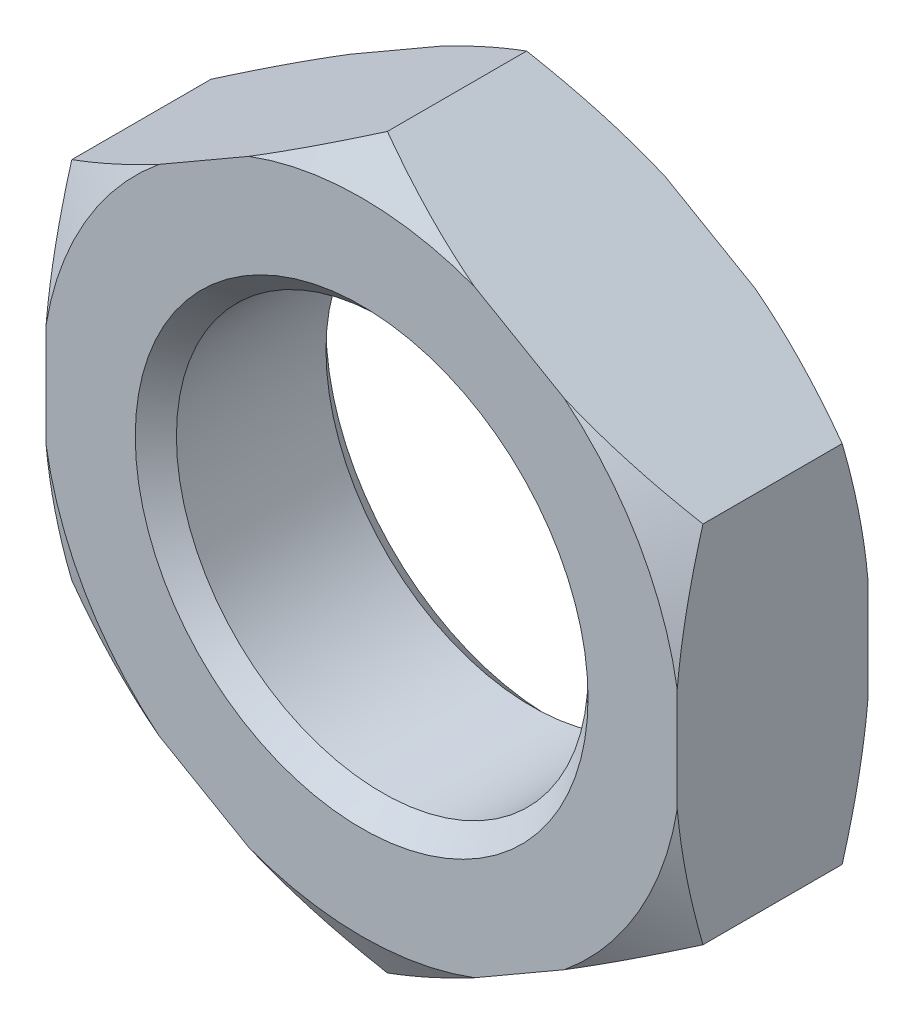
ISO-10303-21;
HEADER;
FILE_DESCRIPTION(('STEP AP214'),'2;1');
FILE_NAME('part.step','',(''),(''),'','','');
FILE_SCHEMA(('AUTOMOTIVE_DESIGN { 1 0 10303 214 1 1 1 1 }'));
ENDSEC;
DATA;
#1=APPLICATION_CONTEXT('core data for automotive mechanical design processes');
#2=APPLICATION_PROTOCOL_DEFINITION('international standard','automotive_design',2000,#1);
#3=PRODUCT_CONTEXT('',#1,'mechanical');
#4=PRODUCT('Part','Part','',(#3));
#5=PRODUCT_RELATED_PRODUCT_CATEGORY('part','',(#4));
#6=PRODUCT_DEFINITION_FORMATION('','',#4);
#7=PRODUCT_DEFINITION_CONTEXT('part definition',#1,'design');
#8=PRODUCT_DEFINITION('design','',#6,#7);
#9=PRODUCT_DEFINITION_SHAPE('','',#8);
#10=(LENGTH_UNIT() NAMED_UNIT(*) SI_UNIT(.MILLI.,.METRE.));
#11=(NAMED_UNIT(*) PLANE_ANGLE_UNIT() SI_UNIT($,.RADIAN.));
#12=(NAMED_UNIT(*) SI_UNIT($,.STERADIAN.) SOLID_ANGLE_UNIT());
#13=UNCERTAINTY_MEASURE_WITH_UNIT(LENGTH_MEASURE(1.E-05),#10,'distance_accuracy_value','');
#14=(GEOMETRIC_REPRESENTATION_CONTEXT(3) GLOBAL_UNCERTAINTY_ASSIGNED_CONTEXT((#13)) GLOBAL_UNIT_ASSIGNED_CONTEXT((#10,
#11,#12)) REPRESENTATION_CONTEXT('',''));
#15=CARTESIAN_POINT('',(0.,0.,0.));
#16=DIRECTION('',(0.,0.,1.));
#17=DIRECTION('',(1.,0.,0.));
#18=AXIS2_PLACEMENT_3D('',#15,#16,#17);
#19=CARTESIAN_POINT('',(23.,13.2790561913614,6.95));
#20=DIRECTION('',(-0.5,-0.866025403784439,0.));
#21=DIRECTION('',(0.866025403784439,-0.5,0.));
#22=AXIS2_PLACEMENT_3D('',#19,#20,#21);
#23=PLANE('',#22);
#24=CARTESIAN_POINT('',(-15.9747891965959,35.781161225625,2.21668125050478));
#25=CARTESIAN_POINT('',(-15.6134641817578,35.5725501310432,2.02166062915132));
#26=CARTESIAN_POINT('',(-15.251701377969,35.363686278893,1.82772222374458));
#27=CARTESIAN_POINT('',(-14.527223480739,34.9454087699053,1.44222167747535));
#28=CARTESIAN_POINT('',(-14.1645083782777,34.7359951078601,1.25065955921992));
#29=CARTESIAN_POINT('',(-13.0747452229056,34.1068200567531,0.679816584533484));
#30=CARTESIAN_POINT('',(-12.3461634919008,33.6861731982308,0.304424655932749));
#31=CARTESIAN_POINT('',(-10.8819184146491,32.84079090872,-0.435063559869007));
#32=CARTESIAN_POINT('',(-10.1462398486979,32.416046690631,-0.799119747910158));
#33=CARTESIAN_POINT('',(-8.66937230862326,31.5633768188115,-1.51198285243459));
#34=CARTESIAN_POINT('',(-7.92818351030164,31.1354512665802,-1.86079025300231));
#35=CARTESIAN_POINT('',(-6.42047462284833,30.2649751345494,-2.54844753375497));
#36=CARTESIAN_POINT('',(-5.65378988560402,29.8223294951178,-2.88681815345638));
#37=CARTESIAN_POINT('',(-4.11268042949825,28.9325695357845,-3.5394669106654));
#38=CARTESIAN_POINT('',(-3.33825533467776,28.4854549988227,-3.85374387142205));
#39=CARTESIAN_POINT('',(-1.78152012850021,27.5866735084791,-4.45222036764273));
#40=CARTESIAN_POINT('',(-0.999218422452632,27.135011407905,-4.73644887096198));
#41=CARTESIAN_POINT('',(0.574675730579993,26.2263231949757,-5.26828511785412));
#42=CARTESIAN_POINT('',(1.36626696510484,25.7692977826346,-5.51589758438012));
#43=CARTESIAN_POINT('',(2.71080604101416,24.9930277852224,-5.89635562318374));
#44=CARTESIAN_POINT('',(3.26126646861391,24.6752193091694,-6.04092236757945));
#45=CARTESIAN_POINT('',(4.36650850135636,24.0371075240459,-6.30618142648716));
#46=CARTESIAN_POINT('',(4.92129001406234,23.7168042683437,-6.42687425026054));
#47=CARTESIAN_POINT('',(6.03458123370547,23.0740452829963,-6.64165739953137));
#48=CARTESIAN_POINT('',(6.593089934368,22.751590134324,-6.73575462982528));
#49=CARTESIAN_POINT('',(7.71321912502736,22.1048832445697,-6.89496841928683));
#50=CARTESIAN_POINT('',(8.27483958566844,21.7806315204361,-6.96008525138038));
#51=CARTESIAN_POINT('',(9.39360548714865,21.1347117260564,-7.05890104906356));
#52=CARTESIAN_POINT('',(9.95072714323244,20.813057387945,-7.09295613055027));
#53=CARTESIAN_POINT('',(11.0657460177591,20.1693009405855,-7.12992128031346));
#54=CARTESIAN_POINT('',(11.623643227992,19.8471988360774,-7.13283167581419));
#55=CARTESIAN_POINT('',(12.7389327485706,19.203286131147,-7.10741538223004));
#56=CARTESIAN_POINT('',(13.2963250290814,18.8814755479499,-7.07908695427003));
#57=CARTESIAN_POINT('',(14.4093162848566,18.2388897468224,-6.99205266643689));
#58=CARTESIAN_POINT('',(14.9649152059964,17.9181145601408,-6.93334589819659));
#59=CARTESIAN_POINT('',(16.2771146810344,17.1605158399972,-6.76030661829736));
#60=CARTESIAN_POINT('',(17.0324867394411,16.7244015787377,-6.63345679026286));
#61=CARTESIAN_POINT('',(18.5361378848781,15.8562681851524,-6.33187182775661));
#62=CARTESIAN_POINT('',(19.2844146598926,15.4242503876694,-6.15712160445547));
#63=CARTESIAN_POINT('',(20.7736014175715,14.5644680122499,-5.76635535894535));
#64=CARTESIAN_POINT('',(21.5145026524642,14.1367084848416,-5.55029534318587));
#65=CARTESIAN_POINT('',(22.9879614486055,13.2860066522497,-5.08371928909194));
#66=CARTESIAN_POINT('',(23.720519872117,12.8630638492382,-4.83320684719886));
#67=CARTESIAN_POINT('',(25.1865297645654,12.0166626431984,-4.3005093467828));
#68=CARTESIAN_POINT('',(25.9198870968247,11.5932585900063,-4.0179812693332));
#69=CARTESIAN_POINT('',(27.3788320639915,10.7509363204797,-3.42917616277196));
#70=CARTESIAN_POINT('',(28.1044244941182,10.3320153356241,-3.12291488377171));
#71=CARTESIAN_POINT('',(29.5489532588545,9.49801626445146,-2.49087030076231));
#72=CARTESIAN_POINT('',(30.2678913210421,9.0829371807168,-2.1650922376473));
#73=CARTESIAN_POINT('',(31.7002116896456,8.25598663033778,-1.49737747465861));
#74=CARTESIAN_POINT('',(32.4135932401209,7.84411560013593,-1.15543861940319));
#75=CARTESIAN_POINT('',(33.6187984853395,7.14829002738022,-0.564461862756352));
#76=CARTESIAN_POINT('',(34.1118935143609,6.86360147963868,-0.318866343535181));
#77=CARTESIAN_POINT('',(35.0959178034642,6.29547479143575,0.177991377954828));
#78=CARTESIAN_POINT('',(35.5868471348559,6.01203660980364,0.429253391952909));
#79=CARTESIAN_POINT('',(36.5615831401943,5.4492725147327,0.934092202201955));
#80=CARTESIAN_POINT('',(37.0454102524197,5.16993480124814,1.18761646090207));
#81=CARTESIAN_POINT('',(38.0113463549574,4.612251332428,1.6990194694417));
#82=CARTESIAN_POINT('',(38.4934553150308,4.33390559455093,1.95689829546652));
#83=CARTESIAN_POINT('',(38.9747891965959,4.05600734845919,2.21668125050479));
#84=B_SPLINE_CURVE_WITH_KNOTS('',3,(#24,#25,#26,#27,#28,#29,#30,#31,#32,#33,#34,#35,#36,#37,#38,
#39,#40,#41,#42,#43,#44,#45,#46,#47,#48,#49,#50,#51,#52,#53,#54,#55,#56,#57,#58,#59,#60,#61,#62,
#63,#64,#65,#66,#67,#68,#69,#70,#71,#72,#73,#74,#75,#76,#77,#78,#79,#80,#81,#82,#83),
.UNSPECIFIED.,.F.,.F.,(4,2,2,2,2,2,2,2,2,2,2,2,2,2,2,2,2,2,2,2,2,2,2,2,2,2,2,2,2,4),(0.,
1.38165067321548,2.76331448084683,5.52696407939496,8.29947936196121,11.0719065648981,
13.9148838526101,16.7579999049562,19.5983496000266,22.4383326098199,24.3934941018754,
26.3486138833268,28.3032256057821,30.2578189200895,32.1897107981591,34.1215823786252,
36.0535615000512,37.9855983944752,40.6282126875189,43.2716603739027,45.9179390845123,
48.5639417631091,51.2415955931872,53.91748741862,56.5926638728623,59.2681981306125,
61.1284279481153,62.9885960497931,64.8291026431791,66.6696414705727),.UNSPECIFIED.);
#85=CARTESIAN_POINT('',(0.,26.5581123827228,-5.07361162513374));
#86=VERTEX_POINT('',#85);
#87=CARTESIAN_POINT('',(8.22874991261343,21.8072414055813,-6.95));
#88=VERTEX_POINT('',#87);
#89=EDGE_CURVE('E177',#86,#88,#84,.T.);
#90=ORIENTED_EDGE('',*,*,#89,.F.);
#91=DIRECTION('',(0.,0.,-1.));
#92=VECTOR('',#91,1.);
#93=CARTESIAN_POINT('',(0.,26.5581123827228,6.95));
#94=LINE('',#93,#92);
#95=CARTESIAN_POINT('',(0.,26.5581123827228,5.07361162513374));
#96=VERTEX_POINT('',#95);
#97=EDGE_CURVE('E222',#96,#86,#94,.T.);
#98=ORIENTED_EDGE('',*,*,#97,.F.);
#99=CARTESIAN_POINT('',(38.9747891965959,4.05600734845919,-2.21668125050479));
#100=CARTESIAN_POINT('',(38.6134641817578,4.26461844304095,-2.02166062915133));
#101=CARTESIAN_POINT('',(38.251701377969,4.47348229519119,-1.82772222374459));
#102=CARTESIAN_POINT('',(37.527223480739,4.89175980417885,-1.44222167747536));
#103=CARTESIAN_POINT('',(37.1645083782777,5.10117346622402,-1.25065955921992));
#104=CARTESIAN_POINT('',(36.0747452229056,5.73034851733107,-0.679816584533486));
#105=CARTESIAN_POINT('',(35.3461634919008,6.15099537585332,-0.304424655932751));
#106=CARTESIAN_POINT('',(33.8819184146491,6.99637766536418,0.435063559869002));
#107=CARTESIAN_POINT('',(33.1462398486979,7.42112188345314,0.799119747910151));
#108=CARTESIAN_POINT('',(31.6693723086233,8.27379175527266,1.51198285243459));
#109=CARTESIAN_POINT('',(30.9281835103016,8.70171730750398,1.8607902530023));
#110=CARTESIAN_POINT('',(29.4204746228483,9.57219343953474,2.54844753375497));
#111=CARTESIAN_POINT('',(28.653789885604,10.0148390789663,2.88681815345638));
#112=CARTESIAN_POINT('',(27.1126804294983,10.9045990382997,3.5394669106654));
#113=CARTESIAN_POINT('',(26.3382553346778,11.3517135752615,3.85374387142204));
#114=CARTESIAN_POINT('',(24.7815201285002,12.250495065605,4.45222036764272));
#115=CARTESIAN_POINT('',(23.9992184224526,12.7021571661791,4.73644887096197));
#116=CARTESIAN_POINT('',(22.42532426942,13.6108453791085,5.26828511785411));
#117=CARTESIAN_POINT('',(21.6337330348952,14.0678707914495,5.51589758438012));
#118=CARTESIAN_POINT('',(20.2891939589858,14.8441407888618,5.89635562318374));
#119=CARTESIAN_POINT('',(19.7387335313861,15.1619492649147,6.04092236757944));
#120=CARTESIAN_POINT('',(18.6334914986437,15.8000610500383,6.30618142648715));
#121=CARTESIAN_POINT('',(18.0787099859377,16.1203643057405,6.42687425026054));
#122=CARTESIAN_POINT('',(16.9654187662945,16.7631232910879,6.64165739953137));
#123=CARTESIAN_POINT('',(16.406910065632,17.0855784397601,6.73575462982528));
#124=CARTESIAN_POINT('',(15.2867808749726,17.7322853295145,6.89496841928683));
#125=CARTESIAN_POINT('',(14.7251604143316,18.056537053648,6.96008525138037));
#126=CARTESIAN_POINT('',(13.6063945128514,18.7024568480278,7.05890104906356));
#127=CARTESIAN_POINT('',(13.0492728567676,19.0241111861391,7.09295613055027));
#128=CARTESIAN_POINT('',(11.9342539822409,19.6678676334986,7.12992128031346));
#129=CARTESIAN_POINT('',(11.376356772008,19.9899697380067,7.13283167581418));
#130=CARTESIAN_POINT('',(10.2610672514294,20.6338824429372,7.10741538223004));
#131=CARTESIAN_POINT('',(9.70367497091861,20.9556930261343,7.07908695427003));
#132=CARTESIAN_POINT('',(8.5906837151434,21.5982788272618,6.99205266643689));
#133=CARTESIAN_POINT('',(8.03508479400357,21.9190540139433,6.9333458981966));
#134=CARTESIAN_POINT('',(6.72288531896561,22.676652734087,6.76030661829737));
#135=CARTESIAN_POINT('',(5.96751326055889,23.1127669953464,6.63345679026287));
#136=CARTESIAN_POINT('',(4.46386211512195,23.9809003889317,6.33187182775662));
#137=CARTESIAN_POINT('',(3.71558534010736,24.4129181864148,6.15712160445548));
#138=CARTESIAN_POINT('',(2.22639858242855,25.2727005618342,5.76635535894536));
#139=CARTESIAN_POINT('',(1.48549734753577,25.7004600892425,5.55029534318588));
#140=CARTESIAN_POINT('',(0.0120385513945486,26.5511619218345,5.08371928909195));
#141=CARTESIAN_POINT('',(-0.720519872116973,26.974104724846,4.83320684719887));
#142=CARTESIAN_POINT('',(-2.18652976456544,27.8205059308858,4.30050934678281));
#143=CARTESIAN_POINT('',(-2.91988709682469,28.2439099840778,4.01798126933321));
#144=CARTESIAN_POINT('',(-4.37883206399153,29.0862322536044,3.42917616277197));
#145=CARTESIAN_POINT('',(-5.10442449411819,29.50515323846,3.12291488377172));
#146=CARTESIAN_POINT('',(-6.54895325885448,30.3391523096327,2.49087030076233));
#147=CARTESIAN_POINT('',(-7.26789132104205,30.7542313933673,2.16509223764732));
#148=CARTESIAN_POINT('',(-8.70021168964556,31.5811819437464,1.49737747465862));
#149=CARTESIAN_POINT('',(-9.4135932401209,31.9930529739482,1.15543861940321));
#150=CARTESIAN_POINT('',(-10.6187984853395,32.6888785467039,0.564461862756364));
#151=CARTESIAN_POINT('',(-11.1118935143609,32.9735670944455,0.318866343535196));
#152=CARTESIAN_POINT('',(-12.0959178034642,33.5416937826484,-0.177991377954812));
#153=CARTESIAN_POINT('',(-12.5868471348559,33.8251319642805,-0.429253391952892));
#154=CARTESIAN_POINT('',(-13.5615831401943,34.3878960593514,-0.934092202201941));
#155=CARTESIAN_POINT('',(-14.0454102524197,34.667233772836,-1.18761646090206));
#156=CARTESIAN_POINT('',(-15.0113463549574,35.2249172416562,-1.69901946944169));
#157=CARTESIAN_POINT('',(-15.4934553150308,35.5032629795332,-1.95689829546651));
#158=CARTESIAN_POINT('',(-15.9747891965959,35.781161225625,-2.21668125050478));
#159=B_SPLINE_CURVE_WITH_KNOTS('',3,(#99,#100,#101,#102,#103,#104,#105,#106,#107,#108,#109,#110,
#111,#112,#113,#114,#115,#116,#117,#118,#119,#120,#121,#122,#123,#124,#125,#126,#127,#128,#129,
#130,#131,#132,#133,#134,#135,#136,#137,#138,#139,#140,#141,#142,#143,#144,#145,#146,#147,#148,
#149,#150,#151,#152,#153,#154,#155,#156,#157,#158),.UNSPECIFIED.,.F.,.F.,(4,2,2,2,2,2,2,2,2,2,2,
2,2,2,2,2,2,2,2,2,2,2,2,2,2,2,2,2,2,4),(0.,1.38165067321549,2.76331448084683,5.52696407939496,
8.29947936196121,11.0719065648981,13.91488385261,16.7579999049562,19.5983496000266,
22.4383326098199,24.3934941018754,26.3486138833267,28.3032256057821,30.2578189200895,
32.1897107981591,34.1215823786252,36.0535615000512,37.9855983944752,40.6282126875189,
43.2716603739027,45.9179390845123,48.5639417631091,51.2415955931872,53.91748741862,
56.5926638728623,59.2681981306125,61.1284279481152,62.9885960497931,64.8291026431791,
66.6696414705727),.UNSPECIFIED.);
#160=CARTESIAN_POINT('',(8.22874991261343,21.8072414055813,6.95));
#161=VERTEX_POINT('',#160);
#162=EDGE_CURVE('E372',#161,#96,#159,.T.);
#163=ORIENTED_EDGE('',*,*,#162,.F.);
#164=DIRECTION('',(-0.866025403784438,0.5,0.));
#165=VECTOR('',#164,1.);
#166=CARTESIAN_POINT('',(23.,13.2790561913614,6.95));
#167=LINE('',#166,#165);
#168=CARTESIAN_POINT('',(14.7712500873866,18.0299271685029,6.95));
#169=VERTEX_POINT('',#168);
#170=EDGE_CURVE('E350',#169,#161,#167,.T.);
#171=ORIENTED_EDGE('',*,*,#170,.F.);
#172=CARTESIAN_POINT('',(23.,13.2790561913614,5.07361162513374));
#173=VERTEX_POINT('',#172);
#174=EDGE_CURVE('E194',#173,#169,#159,.T.);
#175=ORIENTED_EDGE('',*,*,#174,.F.);
#176=DIRECTION('',(0.,0.,-1.));
#177=VECTOR('',#176,1.);
#178=CARTESIAN_POINT('',(23.,13.2790561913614,6.95));
#179=LINE('',#178,#177);
#180=CARTESIAN_POINT('',(23.,13.2790561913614,-5.07361162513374));
#181=VERTEX_POINT('',#180);
#182=EDGE_CURVE('E183',#173,#181,#179,.T.);
#183=ORIENTED_EDGE('',*,*,#182,.T.);
#184=CARTESIAN_POINT('',(14.7712500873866,18.0299271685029,-6.95));
#185=VERTEX_POINT('',#184);
#186=EDGE_CURVE('E164',#185,#181,#84,.T.);
#187=ORIENTED_EDGE('',*,*,#186,.F.);
#188=DIRECTION('',(-0.866025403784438,0.5,0.));
#189=VECTOR('',#188,1.);
#190=CARTESIAN_POINT('',(23.,13.2790561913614,-6.95));
#191=LINE('',#190,#189);
#192=EDGE_CURVE('E264',#185,#88,#191,.T.);
#193=ORIENTED_EDGE('',*,*,#192,.T.);
#194=EDGE_LOOP('',(#90,#98,#163,#171,#175,#183,#187,#193));
#195=FACE_BOUND('',#194,.T.);
#196=ADVANCED_FACE('F39',(#195),#23,.F.);
#197=CARTESIAN_POINT('',(0.,26.5581123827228,6.95));
#198=DIRECTION('',(0.5,-0.866025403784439,0.));
#199=DIRECTION('',(0.866025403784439,0.5,0.));
#200=AXIS2_PLACEMENT_3D('',#197,#198,#199);
#201=PLANE('',#200);
#202=CARTESIAN_POINT('',(-38.9747891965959,4.05600734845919,2.21668125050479));
#203=CARTESIAN_POINT('',(-38.6134641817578,4.26461844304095,2.02166062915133));
#204=CARTESIAN_POINT('',(-38.251701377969,4.47348229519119,1.8277222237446));
#205=CARTESIAN_POINT('',(-37.527223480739,4.89175980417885,1.44222167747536));
#206=CARTESIAN_POINT('',(-37.1645083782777,5.10117346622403,1.25065955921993));
#207=CARTESIAN_POINT('',(-36.0747452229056,5.73034851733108,0.67981658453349));
#208=CARTESIAN_POINT('',(-35.3461634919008,6.15099537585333,0.304424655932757));
#209=CARTESIAN_POINT('',(-33.8819184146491,6.99637766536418,-0.435063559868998));
#210=CARTESIAN_POINT('',(-33.1462398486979,7.42112188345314,-0.799119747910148));
#211=CARTESIAN_POINT('',(-31.6693723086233,8.27379175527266,-1.51198285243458));
#212=CARTESIAN_POINT('',(-30.9281835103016,8.70171730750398,-1.8607902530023));
#213=CARTESIAN_POINT('',(-29.4204746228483,9.57219343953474,-2.54844753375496));
#214=CARTESIAN_POINT('',(-28.653789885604,10.0148390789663,-2.88681815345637));
#215=CARTESIAN_POINT('',(-27.1126804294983,10.9045990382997,-3.5394669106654));
#216=CARTESIAN_POINT('',(-26.3382553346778,11.3517135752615,-3.85374387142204));
#217=CARTESIAN_POINT('',(-24.7815201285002,12.250495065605,-4.45222036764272));
#218=CARTESIAN_POINT('',(-23.9992184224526,12.7021571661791,-4.73644887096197));
#219=CARTESIAN_POINT('',(-22.42532426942,13.6108453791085,-5.26828511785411));
#220=CARTESIAN_POINT('',(-21.6337330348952,14.0678707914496,-5.51589758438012));
#221=CARTESIAN_POINT('',(-20.2891939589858,14.8441407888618,-5.89635562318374));
#222=CARTESIAN_POINT('',(-19.7387335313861,15.1619492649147,-6.04092236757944));
#223=CARTESIAN_POINT('',(-18.6334914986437,15.8000610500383,-6.30618142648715));
#224=CARTESIAN_POINT('',(-18.0787099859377,16.1203643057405,-6.42687425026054));
#225=CARTESIAN_POINT('',(-16.9654187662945,16.7631232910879,-6.64165739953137));
#226=CARTESIAN_POINT('',(-16.406910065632,17.0855784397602,-6.73575462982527));
#227=CARTESIAN_POINT('',(-15.2867808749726,17.7322853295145,-6.89496841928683));
#228=CARTESIAN_POINT('',(-14.7251604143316,18.056537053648,-6.96008525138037));
#229=CARTESIAN_POINT('',(-13.6063945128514,18.7024568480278,-7.05890104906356));
#230=CARTESIAN_POINT('',(-13.0492728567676,19.0241111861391,-7.09295613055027));
#231=CARTESIAN_POINT('',(-11.9342539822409,19.6678676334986,-7.12992128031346));
#232=CARTESIAN_POINT('',(-11.376356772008,19.9899697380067,-7.13283167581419));
#233=CARTESIAN_POINT('',(-10.2610672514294,20.6338824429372,-7.10741538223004));
#234=CARTESIAN_POINT('',(-9.70367497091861,20.9556930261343,-7.07908695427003));
#235=CARTESIAN_POINT('',(-8.5906837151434,21.5982788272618,-6.99205266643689));
#236=CARTESIAN_POINT('',(-8.03508479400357,21.9190540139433,-6.9333458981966));
#237=CARTESIAN_POINT('',(-6.72288531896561,22.676652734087,-6.76030661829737));
#238=CARTESIAN_POINT('',(-5.96751326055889,23.1127669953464,-6.63345679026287));
#239=CARTESIAN_POINT('',(-4.46386211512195,23.9809003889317,-6.33187182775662));
#240=CARTESIAN_POINT('',(-3.71558534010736,24.4129181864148,-6.15712160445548));
#241=CARTESIAN_POINT('',(-2.22639858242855,25.2727005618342,-5.76635535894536));
#242=CARTESIAN_POINT('',(-1.48549734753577,25.7004600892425,-5.55029534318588));
#243=CARTESIAN_POINT('',(-0.0120385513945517,26.5511619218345,-5.08371928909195));
#244=CARTESIAN_POINT('',(0.72051987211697,26.974104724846,-4.83320684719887));
#245=CARTESIAN_POINT('',(2.18652976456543,27.8205059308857,-4.30050934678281));
#246=CARTESIAN_POINT('',(2.91988709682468,28.2439099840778,-4.01798126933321));
#247=CARTESIAN_POINT('',(4.37883206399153,29.0862322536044,-3.42917616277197));
#248=CARTESIAN_POINT('',(5.10442449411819,29.50515323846,-3.12291488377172));
#249=CARTESIAN_POINT('',(6.54895325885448,30.3391523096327,-2.49087030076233));
#250=CARTESIAN_POINT('',(7.26789132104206,30.7542313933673,-2.16509223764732));
#251=CARTESIAN_POINT('',(8.70021168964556,31.5811819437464,-1.49737747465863));
#252=CARTESIAN_POINT('',(9.4135932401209,31.9930529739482,-1.15543861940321));
#253=CARTESIAN_POINT('',(10.6187984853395,32.6888785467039,-0.564461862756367));
#254=CARTESIAN_POINT('',(11.1118935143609,32.9735670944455,-0.318866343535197));
#255=CARTESIAN_POINT('',(12.0959178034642,33.5416937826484,0.177991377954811));
#256=CARTESIAN_POINT('',(12.5868471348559,33.8251319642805,0.42925339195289));
#257=CARTESIAN_POINT('',(13.5615831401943,34.3878960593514,0.934092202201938));
#258=CARTESIAN_POINT('',(14.0454102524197,34.667233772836,1.18761646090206));
#259=CARTESIAN_POINT('',(15.0113463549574,35.2249172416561,1.69901946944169));
#260=CARTESIAN_POINT('',(15.4934553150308,35.5032629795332,1.95689829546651));
#261=CARTESIAN_POINT('',(15.974789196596,35.781161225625,2.21668125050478));
#262=B_SPLINE_CURVE_WITH_KNOTS('',3,(#202,#203,#204,#205,#206,#207,#208,#209,#210,#211,#212,
#213,#214,#215,#216,#217,#218,#219,#220,#221,#222,#223,#224,#225,#226,#227,#228,#229,#230,#231,
#232,#233,#234,#235,#236,#237,#238,#239,#240,#241,#242,#243,#244,#245,#246,#247,#248,#249,#250,
#251,#252,#253,#254,#255,#256,#257,#258,#259,#260,#261),.UNSPECIFIED.,.F.,.F.,(4,2,2,2,2,2,2,2,
2,2,2,2,2,2,2,2,2,2,2,2,2,2,2,2,2,2,2,2,2,4),(0.,1.38165067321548,2.76331448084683,
5.52696407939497,8.29947936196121,11.0719065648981,13.91488385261,16.7579999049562,
19.5983496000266,22.4383326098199,24.3934941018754,26.3486138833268,28.3032256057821,
30.2578189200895,32.1897107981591,34.1215823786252,36.0535615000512,37.9855983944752,
40.6282126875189,43.2716603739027,45.9179390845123,48.5639417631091,51.2415955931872,
53.91748741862,56.5926638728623,59.2681981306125,61.1284279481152,62.9885960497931,
64.8291026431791,66.6696414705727),.UNSPECIFIED.);
#263=CARTESIAN_POINT('',(-23.,13.2790561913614,-5.07361162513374));
#264=VERTEX_POINT('',#263);
#265=CARTESIAN_POINT('',(-14.7712500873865,18.0299271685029,-6.95));
#266=VERTEX_POINT('',#265);
#267=EDGE_CURVE('E55',#264,#266,#262,.T.);
#268=ORIENTED_EDGE('',*,*,#267,.F.);
#269=DIRECTION('',(0.,0.,-1.));
#270=VECTOR('',#269,1.);
#271=CARTESIAN_POINT('',(-23.,13.2790561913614,6.95));
#272=LINE('',#271,#270);
#273=CARTESIAN_POINT('',(-23.,13.2790561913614,5.07361162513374));
#274=VERTEX_POINT('',#273);
#275=EDGE_CURVE('E219',#274,#264,#272,.T.);
#276=ORIENTED_EDGE('',*,*,#275,.F.);
#277=CARTESIAN_POINT('',(15.974789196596,35.781161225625,-2.21668125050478));
#278=CARTESIAN_POINT('',(15.6134641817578,35.5725501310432,-2.02166062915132));
#279=CARTESIAN_POINT('',(15.251701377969,35.363686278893,-1.82772222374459));
#280=CARTESIAN_POINT('',(14.527223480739,34.9454087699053,-1.44222167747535));
#281=CARTESIAN_POINT('',(14.1645083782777,34.7359951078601,-1.25065955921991));
#282=CARTESIAN_POINT('',(13.0747452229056,34.1068200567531,-0.679816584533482));
#283=CARTESIAN_POINT('',(12.3461634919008,33.6861731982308,-0.304424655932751));
#284=CARTESIAN_POINT('',(10.8819184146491,32.84079090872,0.435063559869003));
#285=CARTESIAN_POINT('',(10.1462398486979,32.416046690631,0.799119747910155));
#286=CARTESIAN_POINT('',(8.66937230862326,31.5633768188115,1.51198285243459));
#287=CARTESIAN_POINT('',(7.92818351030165,31.1354512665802,1.86079025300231));
#288=CARTESIAN_POINT('',(6.42047462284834,30.2649751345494,2.54844753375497));
#289=CARTESIAN_POINT('',(5.65378988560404,29.8223294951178,2.88681815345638));
#290=CARTESIAN_POINT('',(4.11268042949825,28.9325695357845,3.5394669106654));
#291=CARTESIAN_POINT('',(3.33825533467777,28.4854549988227,3.85374387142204));
#292=CARTESIAN_POINT('',(1.78152012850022,27.5866735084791,4.45222036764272));
#293=CARTESIAN_POINT('',(0.999218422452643,27.135011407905,4.73644887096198));
#294=CARTESIAN_POINT('',(-0.574675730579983,26.2263231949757,5.26828511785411));
#295=CARTESIAN_POINT('',(-1.36626696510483,25.7692977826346,5.51589758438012));
#296=CARTESIAN_POINT('',(-2.71080604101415,24.9930277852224,5.89635562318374));
#297=CARTESIAN_POINT('',(-3.2612664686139,24.6752193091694,6.04092236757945));
#298=CARTESIAN_POINT('',(-4.36650850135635,24.0371075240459,6.30618142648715));
#299=CARTESIAN_POINT('',(-4.92129001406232,23.7168042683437,6.42687425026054));
#300=CARTESIAN_POINT('',(-6.03458123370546,23.0740452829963,6.64165739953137));
#301=CARTESIAN_POINT('',(-6.59308993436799,22.751590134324,6.73575462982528));
#302=CARTESIAN_POINT('',(-7.71321912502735,22.1048832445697,6.89496841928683));
#303=CARTESIAN_POINT('',(-8.27483958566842,21.7806315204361,6.96008525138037));
#304=CARTESIAN_POINT('',(-9.39360548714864,21.1347117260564,7.05890104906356));
#305=CARTESIAN_POINT('',(-9.95072714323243,20.813057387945,7.09295613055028));
#306=CARTESIAN_POINT('',(-11.0657460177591,20.1693009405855,7.12992128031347));
#307=CARTESIAN_POINT('',(-11.623643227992,19.8471988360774,7.13283167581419));
#308=CARTESIAN_POINT('',(-12.7389327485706,19.203286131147,7.10741538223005));
#309=CARTESIAN_POINT('',(-13.2963250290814,18.8814755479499,7.07908695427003));
#310=CARTESIAN_POINT('',(-14.4093162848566,18.2388897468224,6.99205266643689));
#311=CARTESIAN_POINT('',(-14.9649152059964,17.9181145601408,6.9333458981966));
#312=CARTESIAN_POINT('',(-16.2771146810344,17.1605158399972,6.76030661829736));
#313=CARTESIAN_POINT('',(-17.0324867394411,16.7244015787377,6.63345679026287));
#314=CARTESIAN_POINT('',(-18.536137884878,15.8562681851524,6.33187182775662));
#315=CARTESIAN_POINT('',(-19.2844146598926,15.4242503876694,6.15712160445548));
#316=CARTESIAN_POINT('',(-20.7736014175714,14.5644680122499,5.76635535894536));
#317=CARTESIAN_POINT('',(-21.5145026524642,14.1367084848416,5.55029534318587));
#318=CARTESIAN_POINT('',(-22.9879614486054,13.2860066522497,5.08371928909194));
#319=CARTESIAN_POINT('',(-23.720519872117,12.8630638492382,4.83320684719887));
#320=CARTESIAN_POINT('',(-25.1865297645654,12.0166626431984,4.30050934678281));
#321=CARTESIAN_POINT('',(-25.9198870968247,11.5932585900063,4.01798126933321));
#322=CARTESIAN_POINT('',(-27.3788320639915,10.7509363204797,3.42917616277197));
#323=CARTESIAN_POINT('',(-28.1044244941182,10.3320153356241,3.12291488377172));
#324=CARTESIAN_POINT('',(-29.5489532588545,9.49801626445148,2.49087030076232));
#325=CARTESIAN_POINT('',(-30.2678913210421,9.08293718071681,2.16509223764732));
#326=CARTESIAN_POINT('',(-31.7002116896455,8.2559866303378,1.49737747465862));
#327=CARTESIAN_POINT('',(-32.4135932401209,7.84411560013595,1.15543861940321));
#328=CARTESIAN_POINT('',(-33.6187984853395,7.14829002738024,0.564461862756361));
#329=CARTESIAN_POINT('',(-34.1118935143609,6.8636014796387,0.318866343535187));
#330=CARTESIAN_POINT('',(-35.0959178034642,6.29547479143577,-0.177991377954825));
#331=CARTESIAN_POINT('',(-35.5868471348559,6.01203660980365,-0.429253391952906));
#332=CARTESIAN_POINT('',(-36.5615831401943,5.44927251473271,-0.934092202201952));
#333=CARTESIAN_POINT('',(-37.0454102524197,5.16993480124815,-1.18761646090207));
#334=CARTESIAN_POINT('',(-38.0113463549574,4.61225133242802,-1.6990194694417));
#335=CARTESIAN_POINT('',(-38.4934553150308,4.33390559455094,-1.95689829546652));
#336=CARTESIAN_POINT('',(-38.9747891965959,4.05600734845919,-2.21668125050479));
#337=B_SPLINE_CURVE_WITH_KNOTS('',3,(#277,#278,#279,#280,#281,#282,#283,#284,#285,#286,#287,
#288,#289,#290,#291,#292,#293,#294,#295,#296,#297,#298,#299,#300,#301,#302,#303,#304,#305,#306,
#307,#308,#309,#310,#311,#312,#313,#314,#315,#316,#317,#318,#319,#320,#321,#322,#323,#324,#325,
#326,#327,#328,#329,#330,#331,#332,#333,#334,#335,#336),.UNSPECIFIED.,.F.,.F.,(4,2,2,2,2,2,2,2,
2,2,2,2,2,2,2,2,2,2,2,2,2,2,2,2,2,2,2,2,2,4),(0.,1.38165067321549,2.76331448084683,
5.52696407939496,8.29947936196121,11.0719065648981,13.91488385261,16.7579999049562,
19.5983496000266,22.4383326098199,24.3934941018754,26.3486138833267,28.3032256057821,
30.2578189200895,32.1897107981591,34.1215823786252,36.0535615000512,37.9855983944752,
40.6282126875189,43.2716603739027,45.9179390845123,48.5639417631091,51.2415955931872,
53.91748741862,56.5926638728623,59.2681981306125,61.1284279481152,62.9885960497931,
64.8291026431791,66.6696414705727),.UNSPECIFIED.);
#338=CARTESIAN_POINT('',(-14.7712500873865,18.0299271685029,6.95));
#339=VERTEX_POINT('',#338);
#340=EDGE_CURVE('E343',#339,#274,#337,.T.);
#341=ORIENTED_EDGE('',*,*,#340,.F.);
#342=DIRECTION('',(-0.866025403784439,-0.5,0.));
#343=VECTOR('',#342,1.);
#344=CARTESIAN_POINT('',(0.,26.5581123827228,6.95));
#345=LINE('',#344,#343);
#346=CARTESIAN_POINT('',(-8.22874991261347,21.8072414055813,6.95));
#347=VERTEX_POINT('',#346);
#348=EDGE_CURVE('E354',#347,#339,#345,.T.);
#349=ORIENTED_EDGE('',*,*,#348,.F.);
#350=EDGE_CURVE('E349',#96,#347,#337,.T.);
#351=ORIENTED_EDGE('',*,*,#350,.F.);
#352=ORIENTED_EDGE('',*,*,#97,.T.);
#353=CARTESIAN_POINT('',(-8.22874991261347,21.8072414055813,-6.95));
#354=VERTEX_POINT('',#353);
#355=EDGE_CURVE('E397',#354,#86,#262,.T.);
#356=ORIENTED_EDGE('',*,*,#355,.F.);
#357=DIRECTION('',(-0.866025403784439,-0.5,0.));
#358=VECTOR('',#357,1.);
#359=CARTESIAN_POINT('',(0.,26.5581123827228,-6.95));
#360=LINE('',#359,#358);
#361=EDGE_CURVE('E371',#354,#266,#360,.T.);
#362=ORIENTED_EDGE('',*,*,#361,.T.);
#363=EDGE_LOOP('',(#268,#276,#341,#349,#351,#352,#356,#362));
#364=FACE_BOUND('',#363,.T.);
#365=ADVANCED_FACE('F324',(#364),#201,.F.);
#366=CARTESIAN_POINT('',(-23.,13.2790561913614,6.95));
#367=DIRECTION('',(1.,0.,0.));
#368=DIRECTION('',(0.,0.,-1.));
#369=AXIS2_PLACEMENT_3D('',#366,#367,#368);
#370=PLANE('',#369);
#371=CARTESIAN_POINT('',(-23.,-29.2538453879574,1.07783624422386));
#372=CARTESIAN_POINT('',(-23.,-28.8383770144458,0.889271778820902));
#373=CARTESIAN_POINT('',(-23.,-28.4223346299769,0.701973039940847));
#374=CARTESIAN_POINT('',(-23.,-27.5889998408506,0.330162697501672));
#375=CARTESIAN_POINT('',(-23.,-27.1717074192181,0.145651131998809));
#376=CARTESIAN_POINT('',(-23.,-25.917678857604,-0.403373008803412));
#377=CARTESIAN_POINT('',(-23.,-25.0789307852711,-0.763311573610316));
#378=CARTESIAN_POINT('',(-23.,-23.3917256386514,-1.46990732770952));
#379=CARTESIAN_POINT('',(-23.,-22.5432426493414,-1.81650279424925));
#380=CARTESIAN_POINT('',(-23.,-20.8391057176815,-2.49155128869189));
#381=CARTESIAN_POINT('',(-23.,-19.9834521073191,-2.82000515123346));
#382=CARTESIAN_POINT('',(-23.,-18.2677548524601,-3.45330560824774));
#383=CARTESIAN_POINT('',(-23.,-17.4077478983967,-3.75825111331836));
#384=CARTESIAN_POINT('',(-23.,-15.6785423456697,-4.34120466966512));
#385=CARTESIAN_POINT('',(-23.,-14.8093432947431,-4.61921138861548));
#386=CARTESIAN_POINT('',(-23.,-13.0621643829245,-5.14192267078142));
#387=CARTESIAN_POINT('',(-23.,-12.184197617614,-5.38667068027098));
#388=CARTESIAN_POINT('',(-23.,-10.4181041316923,-5.83631948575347));
#389=CARTESIAN_POINT('',(-23.,-9.52997884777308,-6.04122584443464));
#390=CARTESIAN_POINT('',(-23.,-7.99684396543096,-6.35240422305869));
#391=CARTESIAN_POINT('',(-23.,-7.35416794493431,-6.4701785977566));
#392=CARTESIAN_POINT('',(-23.,-6.06442277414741,-6.67869986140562));
#393=CARTESIAN_POINT('',(-23.,-5.41735376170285,-6.769447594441));
#394=CARTESIAN_POINT('',(-23.,-4.11990528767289,-6.92151653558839));
#395=CARTESIAN_POINT('',(-23.,-3.46952670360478,-6.98284517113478));
#396=CARTESIAN_POINT('',(-23.,-2.16656103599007,-7.07432917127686));
#397=CARTESIAN_POINT('',(-23.,-1.51397395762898,-7.10448460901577));
#398=CARTESIAN_POINT('',(-23.,-0.208435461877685,-7.13268181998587));
#399=CARTESIAN_POINT('',(-23.,0.444515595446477,-7.13074010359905));
#400=CARTESIAN_POINT('',(-23.,1.74952461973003,-7.09484528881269));
#401=CARTESIAN_POINT('',(-23.,2.40158259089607,-7.06089234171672));
#402=CARTESIAN_POINT('',(-23.,3.70339482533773,-6.96201184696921));
#403=CARTESIAN_POINT('',(-23.,4.35314884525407,-6.89708111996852));
#404=CARTESIAN_POINT('',(-23.,5.64906839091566,-6.73811401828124));
#405=CARTESIAN_POINT('',(-23.,6.29523376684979,-6.64407643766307));
#406=CARTESIAN_POINT('',(-23.,7.90516066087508,-6.37559106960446));
#407=CARTESIAN_POINT('',(-23.,8.86615096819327,-6.18444873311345));
#408=CARTESIAN_POINT('',(-23.,10.7766038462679,-5.75131903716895));
#409=CARTESIAN_POINT('',(-23.,11.7260638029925,-5.50932036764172));
#410=CARTESIAN_POINT('',(-23.,13.6153394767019,-4.98303311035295));
#411=CARTESIAN_POINT('',(-23.,14.5551292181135,-4.69865217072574));
#412=CARTESIAN_POINT('',(-23.,16.4236288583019,-4.096058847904));
#413=CARTESIAN_POINT('',(-23.,17.3523395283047,-3.77784883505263));
#414=CARTESIAN_POINT('',(-23.,19.2105193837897,-3.11042350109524));
#415=CARTESIAN_POINT('',(-23.,20.1398751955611,-2.76089453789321));
#416=CARTESIAN_POINT('',(-23.,21.9899018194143,-2.03948813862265));
#417=CARTESIAN_POINT('',(-23.,22.9105720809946,-1.66760929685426));
#418=CARTESIAN_POINT('',(-23.,24.2830789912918,-1.09746398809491));
#419=CARTESIAN_POINT('',(-23.,24.7377529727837,-0.905980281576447));
#420=CARTESIAN_POINT('',(-23.,25.6453895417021,-0.518989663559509));
#421=CARTESIAN_POINT('',(-23.,26.0983521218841,-0.323482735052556));
#422=CARTESIAN_POINT('',(-23.,27.0025836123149,0.0711073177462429));
#423=CARTESIAN_POINT('',(-23.,27.4538529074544,0.270189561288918));
#424=CARTESIAN_POINT('',(-23.,28.3549204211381,0.671635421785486));
#425=CARTESIAN_POINT('',(-23.,28.8047186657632,0.873998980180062));
#426=CARTESIAN_POINT('',(-23.,29.2538453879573,1.07783624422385));
#427=B_SPLINE_CURVE_WITH_KNOTS('',3,(#371,#372,#373,#374,#375,#376,#377,#378,#379,#380,#381,
#382,#383,#384,#385,#386,#387,#388,#389,#390,#391,#392,#393,#394,#395,#396,#397,#398,#399,#400,
#401,#402,#403,#404,#405,#406,#407,#408,#409,#410,#411,#412,#413,#414,#415,#416,#417,#418,#419,
#420,#421,#422,#423,#424,#425,#426),.UNSPECIFIED.,.F.,.F.,(4,2,2,2,2,2,2,2,2,2,2,2,2,2,2,2,2,2,
2,2,2,2,2,2,2,2,2,4),(0.,1.36876728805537,2.73755324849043,5.47558452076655,8.22504691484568,
10.9743827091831,13.7114357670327,16.4486241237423,19.1822017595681,21.9153974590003,
23.8750329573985,25.8346072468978,27.7936865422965,29.7527612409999,31.7108282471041,
33.6688859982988,35.6271447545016,37.5854846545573,40.5231609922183,43.4614913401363,
46.4063206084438,49.3509436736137,52.3293260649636,55.3078959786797,56.7879319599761,
58.2679741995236,59.7476567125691,61.2273128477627),.UNSPECIFIED.);
#428=CARTESIAN_POINT('',(-23.,-13.2790561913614,-5.07361162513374));
#429=VERTEX_POINT('',#428);
#430=CARTESIAN_POINT('',(-23.,-3.77731423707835,-6.95));
#431=VERTEX_POINT('',#430);
#432=EDGE_CURVE('E63',#429,#431,#427,.T.);
#433=ORIENTED_EDGE('',*,*,#432,.F.);
#434=DIRECTION('',(0.,0.,-1.));
#435=VECTOR('',#434,1.);
#436=CARTESIAN_POINT('',(-23.,-13.2790561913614,6.95));
#437=LINE('',#436,#435);
#438=CARTESIAN_POINT('',(-23.,-13.2790561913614,5.07361162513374));
#439=VERTEX_POINT('',#438);
#440=EDGE_CURVE('E215',#439,#429,#437,.T.);
#441=ORIENTED_EDGE('',*,*,#440,.F.);
#442=CARTESIAN_POINT('',(-23.,29.2538453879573,-1.07783624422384));
#443=CARTESIAN_POINT('',(-23.,28.8383770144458,-0.889271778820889));
#444=CARTESIAN_POINT('',(-23.,28.4223346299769,-0.701973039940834));
#445=CARTESIAN_POINT('',(-23.,27.5889998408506,-0.330162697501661));
#446=CARTESIAN_POINT('',(-23.,27.1717074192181,-0.1456511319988));
#447=CARTESIAN_POINT('',(-23.,25.917678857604,0.403373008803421));
#448=CARTESIAN_POINT('',(-23.,25.0789307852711,0.763311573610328));
#449=CARTESIAN_POINT('',(-23.,23.3917256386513,1.46990732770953));
#450=CARTESIAN_POINT('',(-23.,22.5432426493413,1.81650279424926));
#451=CARTESIAN_POINT('',(-23.,20.8391057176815,2.4915512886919));
#452=CARTESIAN_POINT('',(-23.,19.9834521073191,2.82000515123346));
#453=CARTESIAN_POINT('',(-23.,18.2677548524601,3.45330560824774));
#454=CARTESIAN_POINT('',(-23.,17.4077478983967,3.75825111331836));
#455=CARTESIAN_POINT('',(-23.,15.6785423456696,4.34120466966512));
#456=CARTESIAN_POINT('',(-23.,14.8093432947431,4.61921138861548));
#457=CARTESIAN_POINT('',(-23.,13.0621643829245,5.14192267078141));
#458=CARTESIAN_POINT('',(-23.,12.1841976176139,5.38667068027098));
#459=CARTESIAN_POINT('',(-23.,10.4181041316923,5.83631948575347));
#460=CARTESIAN_POINT('',(-23.,9.52997884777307,6.04122584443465));
#461=CARTESIAN_POINT('',(-23.,7.99684396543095,6.35240422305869));
#462=CARTESIAN_POINT('',(-23.,7.3541679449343,6.4701785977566));
#463=CARTESIAN_POINT('',(-23.,6.0644227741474,6.67869986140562));
#464=CARTESIAN_POINT('',(-23.,5.41735376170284,6.769447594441));
#465=CARTESIAN_POINT('',(-23.,4.11990528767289,6.92151653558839));
#466=CARTESIAN_POINT('',(-23.,3.46952670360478,6.98284517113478));
#467=CARTESIAN_POINT('',(-23.,2.16656103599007,7.07432917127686));
#468=CARTESIAN_POINT('',(-23.,1.51397395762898,7.10448460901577));
#469=CARTESIAN_POINT('',(-23.,0.208435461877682,7.13268181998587));
#470=CARTESIAN_POINT('',(-23.,-0.444515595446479,7.13074010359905));
#471=CARTESIAN_POINT('',(-23.,-1.74952461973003,7.09484528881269));
#472=CARTESIAN_POINT('',(-23.,-2.40158259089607,7.06089234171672));
#473=CARTESIAN_POINT('',(-23.,-3.70339482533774,6.96201184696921));
#474=CARTESIAN_POINT('',(-23.,-4.35314884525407,6.89708111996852));
#475=CARTESIAN_POINT('',(-23.,-5.64906839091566,6.73811401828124));
#476=CARTESIAN_POINT('',(-23.,-6.29523376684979,6.64407643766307));
#477=CARTESIAN_POINT('',(-23.,-7.90516066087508,6.37559106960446));
#478=CARTESIAN_POINT('',(-23.,-8.86615096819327,6.18444873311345));
#479=CARTESIAN_POINT('',(-23.,-10.7766038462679,5.75131903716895));
#480=CARTESIAN_POINT('',(-23.,-11.7260638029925,5.50932036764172));
#481=CARTESIAN_POINT('',(-23.,-13.6153394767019,4.98303311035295));
#482=CARTESIAN_POINT('',(-23.,-14.5551292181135,4.69865217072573));
#483=CARTESIAN_POINT('',(-23.,-16.4236288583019,4.09605884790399));
#484=CARTESIAN_POINT('',(-23.,-17.3523395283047,3.77784883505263));
#485=CARTESIAN_POINT('',(-23.,-19.2105193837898,3.11042350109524));
#486=CARTESIAN_POINT('',(-23.,-20.1398751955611,2.7608945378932));
#487=CARTESIAN_POINT('',(-23.,-21.9899018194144,2.03948813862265));
#488=CARTESIAN_POINT('',(-23.,-22.9105720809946,1.66760929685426));
#489=CARTESIAN_POINT('',(-23.,-24.2830789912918,1.09746398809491));
#490=CARTESIAN_POINT('',(-23.,-24.7377529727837,0.905980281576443));
#491=CARTESIAN_POINT('',(-23.,-25.6453895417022,0.518989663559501));
#492=CARTESIAN_POINT('',(-23.,-26.0983521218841,0.323482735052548));
#493=CARTESIAN_POINT('',(-23.,-27.0025836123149,-0.0711073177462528));
#494=CARTESIAN_POINT('',(-23.,-27.4538529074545,-0.27018956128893));
#495=CARTESIAN_POINT('',(-23.,-28.3549204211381,-0.671635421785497));
#496=CARTESIAN_POINT('',(-23.,-28.8047186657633,-0.873998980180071));
#497=CARTESIAN_POINT('',(-23.,-29.2538453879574,-1.07783624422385));
#498=B_SPLINE_CURVE_WITH_KNOTS('',3,(#442,#443,#444,#445,#446,#447,#448,#449,#450,#451,#452,
#453,#454,#455,#456,#457,#458,#459,#460,#461,#462,#463,#464,#465,#466,#467,#468,#469,#470,#471,
#472,#473,#474,#475,#476,#477,#478,#479,#480,#481,#482,#483,#484,#485,#486,#487,#488,#489,#490,
#491,#492,#493,#494,#495,#496,#497),.UNSPECIFIED.,.F.,.F.,(4,2,2,2,2,2,2,2,2,2,2,2,2,2,2,2,2,2,
2,2,2,2,2,2,2,2,2,4),(0.,1.36876728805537,2.73755324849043,5.47558452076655,8.22504691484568,
10.9743827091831,13.7114357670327,16.4486241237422,19.1822017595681,21.9153974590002,
23.8750329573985,25.8346072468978,27.7936865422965,29.7527612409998,31.7108282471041,
33.6688859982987,35.6271447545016,37.5854846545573,40.5231609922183,43.4614913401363,
46.4063206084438,49.3509436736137,52.3293260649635,55.3078959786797,56.7879319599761,
58.2679741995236,59.7476567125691,61.2273128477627),.UNSPECIFIED.);
#499=CARTESIAN_POINT('',(-23.,-3.77731423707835,6.95));
#500=VERTEX_POINT('',#499);
#501=EDGE_CURVE('E330',#500,#439,#498,.T.);
#502=ORIENTED_EDGE('',*,*,#501,.F.);
#503=DIRECTION('',(0.,-1.,0.));
#504=VECTOR('',#503,1.);
#505=CARTESIAN_POINT('',(-23.,13.2790561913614,6.95));
#506=LINE('',#505,#504);
#507=CARTESIAN_POINT('',(-23.,3.77731423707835,6.95));
#508=VERTEX_POINT('',#507);
#509=EDGE_CURVE('E358',#508,#500,#506,.T.);
#510=ORIENTED_EDGE('',*,*,#509,.F.);
#511=EDGE_CURVE('E336',#274,#508,#498,.T.);
#512=ORIENTED_EDGE('',*,*,#511,.F.);
#513=ORIENTED_EDGE('',*,*,#275,.T.);
#514=CARTESIAN_POINT('',(-23.,3.77731423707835,-6.95));
#515=VERTEX_POINT('',#514);
#516=EDGE_CURVE('E313',#515,#264,#427,.T.);
#517=ORIENTED_EDGE('',*,*,#516,.F.);
#518=DIRECTION('',(0.,-1.,0.));
#519=VECTOR('',#518,1.);
#520=CARTESIAN_POINT('',(-23.,13.2790561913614,-6.95));
#521=LINE('',#520,#519);
#522=EDGE_CURVE('E376',#515,#431,#521,.T.);
#523=ORIENTED_EDGE('',*,*,#522,.T.);
#524=EDGE_LOOP('',(#433,#441,#502,#510,#512,#513,#517,#523));
#525=FACE_BOUND('',#524,.T.);
#526=ADVANCED_FACE('F320',(#525),#370,.F.);
#527=CARTESIAN_POINT('',(-23.,-13.2790561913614,6.95));
#528=DIRECTION('',(0.5,0.866025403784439,0.));
#529=DIRECTION('',(-0.866025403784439,0.5,0.));
#530=AXIS2_PLACEMENT_3D('',#527,#528,#529);
#531=PLANE('',#530);
#532=CARTESIAN_POINT('',(15.9747891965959,-35.781161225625,2.21668125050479));
#533=CARTESIAN_POINT('',(15.6134641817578,-35.5725501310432,2.02166062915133));
#534=CARTESIAN_POINT('',(15.251701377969,-35.363686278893,1.8277222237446));
#535=CARTESIAN_POINT('',(14.527223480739,-34.9454087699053,1.44222167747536));
#536=CARTESIAN_POINT('',(14.1645083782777,-34.7359951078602,1.25065955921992));
#537=CARTESIAN_POINT('',(13.0747452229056,-34.1068200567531,0.679816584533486));
#538=CARTESIAN_POINT('',(12.3461634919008,-33.6861731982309,0.304424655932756));
#539=CARTESIAN_POINT('',(10.8819184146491,-32.84079090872,-0.435063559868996));
#540=CARTESIAN_POINT('',(10.1462398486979,-32.416046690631,-0.799119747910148));
#541=CARTESIAN_POINT('',(8.66937230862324,-31.5633768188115,-1.51198285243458));
#542=CARTESIAN_POINT('',(7.92818351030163,-31.1354512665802,-1.8607902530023));
#543=CARTESIAN_POINT('',(6.42047462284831,-30.2649751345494,-2.54844753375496));
#544=CARTESIAN_POINT('',(5.65378988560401,-29.8223294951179,-2.88681815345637));
#545=CARTESIAN_POINT('',(4.11268042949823,-28.9325695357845,-3.53946691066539));
#546=CARTESIAN_POINT('',(3.33825533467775,-28.4854549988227,-3.85374387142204));
#547=CARTESIAN_POINT('',(1.7815201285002,-27.5866735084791,-4.45222036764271));
#548=CARTESIAN_POINT('',(0.999218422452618,-27.1350114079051,-4.73644887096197));
#549=CARTESIAN_POINT('',(-0.574675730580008,-26.2263231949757,-5.2682851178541));
#550=CARTESIAN_POINT('',(-1.36626696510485,-25.7692977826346,-5.51589758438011));
#551=CARTESIAN_POINT('',(-2.71080604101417,-24.9930277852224,-5.89635562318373));
#552=CARTESIAN_POINT('',(-3.26126646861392,-24.6752193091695,-6.04092236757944));
#553=CARTESIAN_POINT('',(-4.36650850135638,-24.0371075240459,-6.30618142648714));
#554=CARTESIAN_POINT('',(-4.92129001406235,-23.7168042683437,-6.42687425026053));
#555=CARTESIAN_POINT('',(-6.03458123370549,-23.0740452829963,-6.64165739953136));
#556=CARTESIAN_POINT('',(-6.59308993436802,-22.751590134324,-6.73575462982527));
#557=CARTESIAN_POINT('',(-7.71321912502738,-22.1048832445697,-6.89496841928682));
#558=CARTESIAN_POINT('',(-8.27483958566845,-21.7806315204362,-6.96008525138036));
#559=CARTESIAN_POINT('',(-9.39360548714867,-21.1347117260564,-7.05890104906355));
#560=CARTESIAN_POINT('',(-9.95072714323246,-20.813057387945,-7.09295613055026));
#561=CARTESIAN_POINT('',(-11.0657460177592,-20.1693009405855,-7.12992128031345));
#562=CARTESIAN_POINT('',(-11.623643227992,-19.8471988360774,-7.13283167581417));
#563=CARTESIAN_POINT('',(-12.7389327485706,-19.203286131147,-7.10741538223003));
#564=CARTESIAN_POINT('',(-13.2963250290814,-18.8814755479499,-7.07908695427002));
#565=CARTESIAN_POINT('',(-14.4093162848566,-18.2388897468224,-6.99205266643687));
#566=CARTESIAN_POINT('',(-14.9649152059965,-17.9181145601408,-6.93334589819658));
#567=CARTESIAN_POINT('',(-16.2771146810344,-17.1605158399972,-6.76030661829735));
#568=CARTESIAN_POINT('',(-17.0324867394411,-16.7244015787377,-6.63345679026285));
#569=CARTESIAN_POINT('',(-18.5361378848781,-15.8562681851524,-6.3318718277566));
#570=CARTESIAN_POINT('',(-19.2844146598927,-15.4242503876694,-6.15712160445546));
#571=CARTESIAN_POINT('',(-20.7736014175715,-14.5644680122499,-5.76635535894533));
#572=CARTESIAN_POINT('',(-21.5145026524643,-14.1367084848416,-5.55029534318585));
#573=CARTESIAN_POINT('',(-22.9879614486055,-13.2860066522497,-5.08371928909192));
#574=CARTESIAN_POINT('',(-23.720519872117,-12.8630638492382,-4.83320684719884));
#575=CARTESIAN_POINT('',(-25.1865297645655,-12.0166626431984,-4.30050934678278));
#576=CARTESIAN_POINT('',(-25.9198870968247,-11.5932585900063,-4.01798126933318));
#577=CARTESIAN_POINT('',(-27.3788320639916,-10.7509363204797,-3.42917616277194));
#578=CARTESIAN_POINT('',(-28.1044244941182,-10.3320153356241,-3.12291488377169));
#579=CARTESIAN_POINT('',(-29.5489532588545,-9.49801626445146,-2.49087030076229));
#580=CARTESIAN_POINT('',(-30.2678913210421,-9.0829371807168,-2.16509223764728));
#581=CARTESIAN_POINT('',(-31.7002116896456,-8.25598663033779,-1.49737747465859));
#582=CARTESIAN_POINT('',(-32.413593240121,-7.84411560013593,-1.15543861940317));
#583=CARTESIAN_POINT('',(-33.6187984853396,-7.14829002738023,-0.564461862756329));
#584=CARTESIAN_POINT('',(-34.1118935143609,-6.86360147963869,-0.318866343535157));
#585=CARTESIAN_POINT('',(-35.0959178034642,-6.29547479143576,0.177991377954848));
#586=CARTESIAN_POINT('',(-35.586847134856,-6.01203660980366,0.429253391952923));
#587=CARTESIAN_POINT('',(-36.5615831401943,-5.44927251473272,0.934092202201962));
#588=CARTESIAN_POINT('',(-37.0454102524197,-5.16993480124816,1.18761646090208));
#589=CARTESIAN_POINT('',(-38.0113463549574,-4.61225133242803,1.6990194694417));
#590=CARTESIAN_POINT('',(-38.4934553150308,-4.33390559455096,1.95689829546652));
#591=CARTESIAN_POINT('',(-38.9747891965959,-4.05600734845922,2.21668125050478));
#592=B_SPLINE_CURVE_WITH_KNOTS('',3,(#532,#533,#534,#535,#536,#537,#538,#539,#540,#541,#542,
#543,#544,#545,#546,#547,#548,#549,#550,#551,#552,#553,#554,#555,#556,#557,#558,#559,#560,#561,
#562,#563,#564,#565,#566,#567,#568,#569,#570,#571,#572,#573,#574,#575,#576,#577,#578,#579,#580,
#581,#582,#583,#584,#585,#586,#587,#588,#589,#590,#591),.UNSPECIFIED.,.F.,.F.,(4,2,2,2,2,2,2,2,
2,2,2,2,2,2,2,2,2,2,2,2,2,2,2,2,2,2,2,2,2,4),(0.,1.38165067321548,2.76331448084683,
5.52696407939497,8.29947936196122,11.0719065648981,13.9148838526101,16.7579999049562,
19.5983496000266,22.4383326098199,24.3934941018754,26.3486138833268,28.3032256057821,
30.2578189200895,32.1897107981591,34.1215823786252,36.0535615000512,37.9855983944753,
40.6282126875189,43.2716603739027,45.9179390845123,48.5639417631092,51.2415955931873,
53.9174874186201,56.5926638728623,59.2681981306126,61.1284279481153,62.9885960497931,
64.8291026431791,66.6696414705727),.UNSPECIFIED.);
#593=CARTESIAN_POINT('',(0.,-26.5581123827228,-5.07361162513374));
#594=VERTEX_POINT('',#593);
#595=CARTESIAN_POINT('',(-8.22874991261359,-21.8072414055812,-6.95));
#596=VERTEX_POINT('',#595);
#597=EDGE_CURVE('E302',#594,#596,#592,.T.);
#598=ORIENTED_EDGE('',*,*,#597,.F.);
#599=DIRECTION('',(0.,0.,-1.));
#600=VECTOR('',#599,1.);
#601=CARTESIAN_POINT('',(0.,-26.5581123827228,6.95));
#602=LINE('',#601,#600);
#603=CARTESIAN_POINT('',(0.,-26.5581123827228,5.07361162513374));
#604=VERTEX_POINT('',#603);
#605=EDGE_CURVE('E203',#604,#594,#602,.T.);
#606=ORIENTED_EDGE('',*,*,#605,.F.);
#607=CARTESIAN_POINT('',(-38.9747891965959,-4.05600734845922,-2.21668125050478));
#608=CARTESIAN_POINT('',(-38.6134641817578,-4.26461844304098,-2.02166062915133));
#609=CARTESIAN_POINT('',(-38.251701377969,-4.47348229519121,-1.82772222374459));
#610=CARTESIAN_POINT('',(-37.527223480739,-4.89175980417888,-1.44222167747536));
#611=CARTESIAN_POINT('',(-37.1645083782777,-5.10117346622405,-1.25065955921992));
#612=CARTESIAN_POINT('',(-36.0747452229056,-5.7303485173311,-0.679816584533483));
#613=CARTESIAN_POINT('',(-35.3461634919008,-6.15099537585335,-0.304424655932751));
#614=CARTESIAN_POINT('',(-33.8819184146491,-6.99637766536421,0.435063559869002));
#615=CARTESIAN_POINT('',(-33.1462398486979,-7.42112188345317,0.799119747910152));
#616=CARTESIAN_POINT('',(-31.6693723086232,-8.27379175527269,1.51198285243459));
#617=CARTESIAN_POINT('',(-30.9281835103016,-8.70171730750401,1.86079025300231));
#618=CARTESIAN_POINT('',(-29.4204746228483,-9.57219343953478,2.54844753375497));
#619=CARTESIAN_POINT('',(-28.653789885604,-10.0148390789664,2.88681815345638));
#620=CARTESIAN_POINT('',(-27.1126804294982,-10.9045990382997,3.5394669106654));
#621=CARTESIAN_POINT('',(-26.3382553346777,-11.3517135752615,3.85374387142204));
#622=CARTESIAN_POINT('',(-24.7815201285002,-12.2504950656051,4.45222036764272));
#623=CARTESIAN_POINT('',(-23.9992184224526,-12.7021571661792,4.73644887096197));
#624=CARTESIAN_POINT('',(-22.42532426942,-13.6108453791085,5.26828511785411));
#625=CARTESIAN_POINT('',(-21.6337330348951,-14.0678707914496,5.51589758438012));
#626=CARTESIAN_POINT('',(-20.2891939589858,-14.8441407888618,5.89635562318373));
#627=CARTESIAN_POINT('',(-19.7387335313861,-15.1619492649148,6.04092236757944));
#628=CARTESIAN_POINT('',(-18.6334914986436,-15.8000610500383,6.30618142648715));
#629=CARTESIAN_POINT('',(-18.0787099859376,-16.1203643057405,6.42687425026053));
#630=CARTESIAN_POINT('',(-16.9654187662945,-16.7631232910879,6.64165739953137));
#631=CARTESIAN_POINT('',(-16.406910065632,-17.0855784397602,6.73575462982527));
#632=CARTESIAN_POINT('',(-15.2867808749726,-17.7322853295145,6.89496841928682));
#633=CARTESIAN_POINT('',(-14.7251604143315,-18.0565370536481,6.96008525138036));
#634=CARTESIAN_POINT('',(-13.6063945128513,-18.7024568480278,7.05890104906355));
#635=CARTESIAN_POINT('',(-13.0492728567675,-19.0241111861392,7.09295613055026));
#636=CARTESIAN_POINT('',(-11.9342539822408,-19.6678676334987,7.12992128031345));
#637=CARTESIAN_POINT('',(-11.3763567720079,-19.9899697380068,7.13283167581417));
#638=CARTESIAN_POINT('',(-10.2610672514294,-20.6338824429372,7.10741538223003));
#639=CARTESIAN_POINT('',(-9.70367497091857,-20.9556930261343,7.07908695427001));
#640=CARTESIAN_POINT('',(-8.59068371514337,-21.5982788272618,6.99205266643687));
#641=CARTESIAN_POINT('',(-8.03508479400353,-21.9190540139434,6.93334589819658));
#642=CARTESIAN_POINT('',(-6.72288531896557,-22.676652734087,6.76030661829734));
#643=CARTESIAN_POINT('',(-5.96751326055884,-23.1127669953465,6.63345679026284));
#644=CARTESIAN_POINT('',(-4.46386211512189,-23.9809003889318,6.33187182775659));
#645=CARTESIAN_POINT('',(-3.7155853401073,-24.4129181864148,6.15712160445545));
#646=CARTESIAN_POINT('',(-2.22639858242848,-25.2727005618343,5.76635535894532));
#647=CARTESIAN_POINT('',(-1.4854973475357,-25.7004600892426,5.55029534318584));
#648=CARTESIAN_POINT('',(-0.0120385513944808,-26.5511619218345,5.08371928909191));
#649=CARTESIAN_POINT('',(0.720519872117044,-26.9741047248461,4.83320684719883));
#650=CARTESIAN_POINT('',(2.18652976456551,-27.8205059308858,4.30050934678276));
#651=CARTESIAN_POINT('',(2.91988709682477,-28.2439099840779,4.01798126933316));
#652=CARTESIAN_POINT('',(4.37883206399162,-29.0862322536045,3.42917616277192));
#653=CARTESIAN_POINT('',(5.10442449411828,-29.5051532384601,3.12291488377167));
#654=CARTESIAN_POINT('',(6.54895325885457,-30.3391523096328,2.49087030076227));
#655=CARTESIAN_POINT('',(7.26789132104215,-30.7542313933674,2.16509223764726));
#656=CARTESIAN_POINT('',(8.70021168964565,-31.5811819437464,1.49737747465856));
#657=CARTESIAN_POINT('',(9.413593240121,-31.9930529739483,1.15543861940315));
#658=CARTESIAN_POINT('',(10.6187984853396,-32.688878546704,0.564461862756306));
#659=CARTESIAN_POINT('',(11.1118935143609,-32.9735670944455,0.31886634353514));
#660=CARTESIAN_POINT('',(12.0959178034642,-33.5416937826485,-0.17799137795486));
#661=CARTESIAN_POINT('',(12.586847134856,-33.8251319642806,-0.429253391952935));
#662=CARTESIAN_POINT('',(13.5615831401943,-34.3878960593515,-0.934092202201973));
#663=CARTESIAN_POINT('',(14.0454102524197,-34.667233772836,-1.18761646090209));
#664=CARTESIAN_POINT('',(15.0113463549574,-35.2249172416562,-1.69901946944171));
#665=CARTESIAN_POINT('',(15.4934553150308,-35.5032629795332,-1.95689829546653));
#666=CARTESIAN_POINT('',(15.9747891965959,-35.781161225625,-2.21668125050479));
#667=B_SPLINE_CURVE_WITH_KNOTS('',3,(#607,#608,#609,#610,#611,#612,#613,#614,#615,#616,#617,
#618,#619,#620,#621,#622,#623,#624,#625,#626,#627,#628,#629,#630,#631,#632,#633,#634,#635,#636,
#637,#638,#639,#640,#641,#642,#643,#644,#645,#646,#647,#648,#649,#650,#651,#652,#653,#654,#655,
#656,#657,#658,#659,#660,#661,#662,#663,#664,#665,#666),.UNSPECIFIED.,.F.,.F.,(4,2,2,2,2,2,2,2,
2,2,2,2,2,2,2,2,2,2,2,2,2,2,2,2,2,2,2,2,2,4),(0.,1.38165067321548,2.76331448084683,
5.52696407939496,8.29947936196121,11.0719065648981,13.9148838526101,16.7579999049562,
19.5983496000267,22.4383326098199,24.3934941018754,26.3486138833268,28.3032256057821,
30.2578189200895,32.1897107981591,34.1215823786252,36.0535615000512,37.9855983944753,
40.628212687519,43.2716603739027,45.9179390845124,48.5639417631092,51.2415955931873,
53.9174874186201,56.5926638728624,59.2681981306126,61.1284279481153,62.9885960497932,
64.8291026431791,66.6696414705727),.UNSPECIFIED.);
#668=CARTESIAN_POINT('',(-8.22874991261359,-21.8072414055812,6.95));
#669=VERTEX_POINT('',#668);
#670=EDGE_CURVE('E338',#669,#604,#667,.T.);
#671=ORIENTED_EDGE('',*,*,#670,.F.);
#672=DIRECTION('',(0.866025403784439,-0.5,0.));
#673=VECTOR('',#672,1.);
#674=CARTESIAN_POINT('',(-23.,-13.2790561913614,6.95));
#675=LINE('',#674,#673);
#676=CARTESIAN_POINT('',(-14.7712500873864,-18.029927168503,6.95));
#677=VERTEX_POINT('',#676);
#678=EDGE_CURVE('E362',#677,#669,#675,.T.);
#679=ORIENTED_EDGE('',*,*,#678,.F.);
#680=EDGE_CURVE('E337',#439,#677,#667,.T.);
#681=ORIENTED_EDGE('',*,*,#680,.F.);
#682=ORIENTED_EDGE('',*,*,#440,.T.);
#683=CARTESIAN_POINT('',(-14.7712500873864,-18.029927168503,-6.95));
#684=VERTEX_POINT('',#683);
#685=EDGE_CURVE('E314',#684,#429,#592,.T.);
#686=ORIENTED_EDGE('',*,*,#685,.F.);
#687=DIRECTION('',(0.866025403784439,-0.5,0.));
#688=VECTOR('',#687,1.);
#689=CARTESIAN_POINT('',(-23.,-13.2790561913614,-6.95));
#690=LINE('',#689,#688);
#691=EDGE_CURVE('E380',#684,#596,#690,.T.);
#692=ORIENTED_EDGE('',*,*,#691,.T.);
#693=EDGE_LOOP('',(#598,#606,#671,#679,#681,#682,#686,#692));
#694=FACE_BOUND('',#693,.T.);
#695=ADVANCED_FACE('F323',(#694),#531,.F.);
#696=CARTESIAN_POINT('',(0.,-26.5581123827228,6.95));
#697=DIRECTION('',(-0.5,0.866025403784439,0.));
#698=DIRECTION('',(-0.866025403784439,-0.5,0.));
#699=AXIS2_PLACEMENT_3D('',#696,#697,#698);
#700=PLANE('',#699);
#701=CARTESIAN_POINT('',(38.9747891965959,-4.05600734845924,2.21668125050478));
#702=CARTESIAN_POINT('',(38.6134641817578,-4.26461844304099,2.02166062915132));
#703=CARTESIAN_POINT('',(38.251701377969,-4.47348229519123,1.82772222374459));
#704=CARTESIAN_POINT('',(37.527223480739,-4.8917598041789,1.44222167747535));
#705=CARTESIAN_POINT('',(37.1645083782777,-5.10117346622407,1.25065955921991));
#706=CARTESIAN_POINT('',(36.0747452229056,-5.73034851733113,0.679816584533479));
#707=CARTESIAN_POINT('',(35.3461634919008,-6.15099537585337,0.304424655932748));
#708=CARTESIAN_POINT('',(33.8819184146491,-6.99637766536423,-0.435063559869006));
#709=CARTESIAN_POINT('',(33.1462398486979,-7.42112188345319,-0.799119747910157));
#710=CARTESIAN_POINT('',(31.6693723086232,-8.27379175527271,-1.51198285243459));
#711=CARTESIAN_POINT('',(30.9281835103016,-8.70171730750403,-1.86079025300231));
#712=CARTESIAN_POINT('',(29.4204746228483,-9.57219343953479,-2.54844753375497));
#713=CARTESIAN_POINT('',(28.653789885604,-10.0148390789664,-2.88681815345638));
#714=CARTESIAN_POINT('',(27.1126804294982,-10.9045990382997,-3.5394669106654));
#715=CARTESIAN_POINT('',(26.3382553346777,-11.3517135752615,-3.85374387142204));
#716=CARTESIAN_POINT('',(24.7815201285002,-12.2504950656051,-4.45222036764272));
#717=CARTESIAN_POINT('',(23.9992184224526,-12.7021571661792,-4.73644887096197));
#718=CARTESIAN_POINT('',(22.42532426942,-13.6108453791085,-5.26828511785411));
#719=CARTESIAN_POINT('',(21.6337330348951,-14.0678707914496,-5.51589758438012));
#720=CARTESIAN_POINT('',(20.2891939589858,-14.8441407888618,-5.89635562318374));
#721=CARTESIAN_POINT('',(19.7387335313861,-15.1619492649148,-6.04092236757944));
#722=CARTESIAN_POINT('',(18.6334914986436,-15.8000610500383,-6.30618142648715));
#723=CARTESIAN_POINT('',(18.0787099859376,-16.1203643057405,-6.42687425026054));
#724=CARTESIAN_POINT('',(16.9654187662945,-16.763123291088,-6.64165739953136));
#725=CARTESIAN_POINT('',(16.406910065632,-17.0855784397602,-6.73575462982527));
#726=CARTESIAN_POINT('',(15.2867808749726,-17.7322853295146,-6.89496841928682));
#727=CARTESIAN_POINT('',(14.7251604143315,-18.0565370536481,-6.96008525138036));
#728=CARTESIAN_POINT('',(13.6063945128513,-18.7024568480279,-7.05890104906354));
#729=CARTESIAN_POINT('',(13.0492728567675,-19.0241111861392,-7.09295613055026));
#730=CARTESIAN_POINT('',(11.9342539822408,-19.6678676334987,-7.12992128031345));
#731=CARTESIAN_POINT('',(11.3763567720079,-19.9899697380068,-7.13283167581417));
#732=CARTESIAN_POINT('',(10.2610672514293,-20.6338824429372,-7.10741538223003));
#733=CARTESIAN_POINT('',(9.70367497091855,-20.9556930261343,-7.07908695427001));
#734=CARTESIAN_POINT('',(8.59068371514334,-21.5982788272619,-6.99205266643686));
#735=CARTESIAN_POINT('',(8.0350847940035,-21.9190540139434,-6.93334589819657));
#736=CARTESIAN_POINT('',(6.72288531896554,-22.6766527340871,-6.76030661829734));
#737=CARTESIAN_POINT('',(5.96751326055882,-23.1127669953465,-6.63345679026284));
#738=CARTESIAN_POINT('',(4.46386211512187,-23.9809003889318,-6.33187182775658));
#739=CARTESIAN_POINT('',(3.71558534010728,-24.4129181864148,-6.15712160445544));
#740=CARTESIAN_POINT('',(2.22639858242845,-25.2727005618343,-5.76635535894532));
#741=CARTESIAN_POINT('',(1.48549734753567,-25.7004600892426,-5.55029534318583));
#742=CARTESIAN_POINT('',(0.0120385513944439,-26.5511619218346,-5.0837192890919));
#743=CARTESIAN_POINT('',(-0.72051987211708,-26.9741047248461,-4.83320684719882));
#744=CARTESIAN_POINT('',(-2.18652976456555,-27.8205059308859,-4.30050934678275));
#745=CARTESIAN_POINT('',(-2.91988709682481,-28.2439099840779,-4.01798126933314));
#746=CARTESIAN_POINT('',(-4.37883206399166,-29.0862322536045,-3.4291761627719));
#747=CARTESIAN_POINT('',(-5.10442449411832,-29.5051532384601,-3.12291488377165));
#748=CARTESIAN_POINT('',(-6.54895325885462,-30.3391523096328,-2.49087030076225));
#749=CARTESIAN_POINT('',(-7.2678913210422,-30.7542313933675,-2.16509223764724));
#750=CARTESIAN_POINT('',(-8.7002116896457,-31.5811819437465,-1.49737747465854));
#751=CARTESIAN_POINT('',(-9.41359324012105,-31.9930529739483,-1.15543861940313));
#752=CARTESIAN_POINT('',(-10.6187984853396,-32.688878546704,-0.564461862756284));
#753=CARTESIAN_POINT('',(-11.111893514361,-32.9735670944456,-0.318866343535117));
#754=CARTESIAN_POINT('',(-12.0959178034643,-33.5416937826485,0.177991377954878));
#755=CARTESIAN_POINT('',(-12.586847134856,-33.8251319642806,0.429253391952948));
#756=CARTESIAN_POINT('',(-13.5615831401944,-34.3878960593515,0.93409220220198));
#757=CARTESIAN_POINT('',(-14.0454102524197,-34.6672337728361,1.18761646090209));
#758=CARTESIAN_POINT('',(-15.0113463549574,-35.2249172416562,1.69901946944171));
#759=CARTESIAN_POINT('',(-15.4934553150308,-35.5032629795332,1.95689829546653));
#760=CARTESIAN_POINT('',(-15.9747891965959,-35.781161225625,2.21668125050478));
#761=B_SPLINE_CURVE_WITH_KNOTS('',3,(#701,#702,#703,#704,#705,#706,#707,#708,#709,#710,#711,
#712,#713,#714,#715,#716,#717,#718,#719,#720,#721,#722,#723,#724,#725,#726,#727,#728,#729,#730,
#731,#732,#733,#734,#735,#736,#737,#738,#739,#740,#741,#742,#743,#744,#745,#746,#747,#748,#749,
#750,#751,#752,#753,#754,#755,#756,#757,#758,#759,#760),.UNSPECIFIED.,.F.,.F.,(4,2,2,2,2,2,2,2,
2,2,2,2,2,2,2,2,2,2,2,2,2,2,2,2,2,2,2,2,2,4),(0.,1.38165067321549,2.76331448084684,
5.52696407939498,8.29947936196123,11.0719065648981,13.9148838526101,16.7579999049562,
19.5983496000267,22.4383326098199,24.3934941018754,26.3486138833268,28.3032256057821,
30.2578189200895,32.1897107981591,34.1215823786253,36.0535615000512,37.9855983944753,
40.628212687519,43.2716603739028,45.9179390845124,48.5639417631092,51.2415955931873,
53.9174874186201,56.5926638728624,59.2681981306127,61.1284279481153,62.9885960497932,
64.8291026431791,66.6696414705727),.UNSPECIFIED.);
#762=CARTESIAN_POINT('',(23.,-13.2790561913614,-5.07361162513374));
#763=VERTEX_POINT('',#762);
#764=CARTESIAN_POINT('',(14.7712500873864,-18.029927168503,-6.95));
#765=VERTEX_POINT('',#764);
#766=EDGE_CURVE('E188',#763,#765,#761,.T.);
#767=ORIENTED_EDGE('',*,*,#766,.F.);
#768=DIRECTION('',(0.,0.,-1.));
#769=VECTOR('',#768,1.);
#770=CARTESIAN_POINT('',(23.,-13.2790561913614,6.95));
#771=LINE('',#770,#769);
#772=CARTESIAN_POINT('',(23.,-13.2790561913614,5.07361162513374));
#773=VERTEX_POINT('',#772);
#774=EDGE_CURVE('E196',#773,#763,#771,.T.);
#775=ORIENTED_EDGE('',*,*,#774,.F.);
#776=CARTESIAN_POINT('',(-15.9747891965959,-35.781161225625,-2.21668125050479));
#777=CARTESIAN_POINT('',(-15.6134641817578,-35.5725501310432,-2.02166062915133));
#778=CARTESIAN_POINT('',(-15.251701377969,-35.363686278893,-1.82772222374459));
#779=CARTESIAN_POINT('',(-14.527223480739,-34.9454087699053,-1.44222167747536));
#780=CARTESIAN_POINT('',(-14.1645083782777,-34.7359951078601,-1.25065955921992));
#781=CARTESIAN_POINT('',(-13.0747452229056,-34.1068200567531,-0.679816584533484));
#782=CARTESIAN_POINT('',(-12.3461634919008,-33.6861731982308,-0.304424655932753));
#783=CARTESIAN_POINT('',(-10.8819184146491,-32.84079090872,0.435063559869));
#784=CARTESIAN_POINT('',(-10.1462398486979,-32.416046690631,0.799119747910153));
#785=CARTESIAN_POINT('',(-8.66937230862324,-31.5633768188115,1.51198285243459));
#786=CARTESIAN_POINT('',(-7.92818351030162,-31.1354512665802,1.86079025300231));
#787=CARTESIAN_POINT('',(-6.42047462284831,-30.2649751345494,2.54844753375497));
#788=CARTESIAN_POINT('',(-5.653789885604,-29.8223294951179,2.88681815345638));
#789=CARTESIAN_POINT('',(-4.11268042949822,-28.9325695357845,3.5394669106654));
#790=CARTESIAN_POINT('',(-3.33825533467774,-28.4854549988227,3.85374387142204));
#791=CARTESIAN_POINT('',(-1.78152012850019,-27.5866735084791,4.45222036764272));
#792=CARTESIAN_POINT('',(-0.999218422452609,-27.135011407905,4.73644887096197));
#793=CARTESIAN_POINT('',(0.574675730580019,-26.2263231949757,5.26828511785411));
#794=CARTESIAN_POINT('',(1.36626696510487,-25.7692977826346,5.51589758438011));
#795=CARTESIAN_POINT('',(2.71080604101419,-24.9930277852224,5.89635562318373));
#796=CARTESIAN_POINT('',(3.26126646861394,-24.6752193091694,6.04092236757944));
#797=CARTESIAN_POINT('',(4.36650850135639,-24.0371075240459,6.30618142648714));
#798=CARTESIAN_POINT('',(4.92129001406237,-23.7168042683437,6.42687425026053));
#799=CARTESIAN_POINT('',(6.0345812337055,-23.0740452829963,6.64165739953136));
#800=CARTESIAN_POINT('',(6.59308993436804,-22.751590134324,6.73575462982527));
#801=CARTESIAN_POINT('',(7.7132191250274,-22.1048832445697,6.89496841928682));
#802=CARTESIAN_POINT('',(8.27483958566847,-21.7806315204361,6.96008525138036));
#803=CARTESIAN_POINT('',(9.39360548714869,-21.1347117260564,7.05890104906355));
#804=CARTESIAN_POINT('',(9.95072714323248,-20.813057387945,7.09295613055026));
#805=CARTESIAN_POINT('',(11.0657460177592,-20.1693009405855,7.12992128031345));
#806=CARTESIAN_POINT('',(11.6236432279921,-19.8471988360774,7.13283167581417));
#807=CARTESIAN_POINT('',(12.7389327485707,-19.203286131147,7.10741538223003));
#808=CARTESIAN_POINT('',(13.2963250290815,-18.8814755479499,7.07908695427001));
#809=CARTESIAN_POINT('',(14.4093162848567,-18.2388897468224,6.99205266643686));
#810=CARTESIAN_POINT('',(14.9649152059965,-17.9181145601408,6.93334589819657));
#811=CARTESIAN_POINT('',(16.2771146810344,-17.1605158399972,6.76030661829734));
#812=CARTESIAN_POINT('',(17.0324867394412,-16.7244015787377,6.63345679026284));
#813=CARTESIAN_POINT('',(18.5361378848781,-15.8562681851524,6.33187182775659));
#814=CARTESIAN_POINT('',(19.2844146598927,-15.4242503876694,6.15712160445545));
#815=CARTESIAN_POINT('',(20.7736014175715,-14.5644680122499,5.76635535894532));
#816=CARTESIAN_POINT('',(21.5145026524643,-14.1367084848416,5.55029534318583));
#817=CARTESIAN_POINT('',(22.9879614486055,-13.2860066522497,5.0837192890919));
#818=CARTESIAN_POINT('',(23.7205198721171,-12.8630638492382,4.83320684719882));
#819=CARTESIAN_POINT('',(25.1865297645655,-12.0166626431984,4.30050934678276));
#820=CARTESIAN_POINT('',(25.9198870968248,-11.5932585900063,4.01798126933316));
#821=CARTESIAN_POINT('',(27.3788320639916,-10.7509363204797,3.42917616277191));
#822=CARTESIAN_POINT('',(28.1044244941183,-10.3320153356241,3.12291488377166));
#823=CARTESIAN_POINT('',(29.5489532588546,-9.49801626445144,2.49087030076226));
#824=CARTESIAN_POINT('',(30.2678913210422,-9.08293718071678,2.16509223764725));
#825=CARTESIAN_POINT('',(31.7002116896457,-8.25598663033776,1.49737747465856));
#826=CARTESIAN_POINT('',(32.413593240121,-7.8441156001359,1.15543861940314));
#827=CARTESIAN_POINT('',(33.6187984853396,-7.14829002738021,0.564461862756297));
#828=CARTESIAN_POINT('',(34.1118935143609,-6.86360147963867,0.318866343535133));
#829=CARTESIAN_POINT('',(35.0959178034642,-6.29547479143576,-0.177991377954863));
#830=CARTESIAN_POINT('',(35.586847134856,-6.01203660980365,-0.429253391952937));
#831=CARTESIAN_POINT('',(36.5615831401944,-5.44927251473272,-0.93409220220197));
#832=CARTESIAN_POINT('',(37.0454102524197,-5.16993480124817,-1.18761646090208));
#833=CARTESIAN_POINT('',(38.0113463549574,-4.61225133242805,-1.6990194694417));
#834=CARTESIAN_POINT('',(38.4934553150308,-4.33390559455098,-1.95689829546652));
#835=CARTESIAN_POINT('',(38.9747891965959,-4.05600734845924,-2.21668125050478));
#836=B_SPLINE_CURVE_WITH_KNOTS('',3,(#776,#777,#778,#779,#780,#781,#782,#783,#784,#785,#786,
#787,#788,#789,#790,#791,#792,#793,#794,#795,#796,#797,#798,#799,#800,#801,#802,#803,#804,#805,
#806,#807,#808,#809,#810,#811,#812,#813,#814,#815,#816,#817,#818,#819,#820,#821,#822,#823,#824,
#825,#826,#827,#828,#829,#830,#831,#832,#833,#834,#835),.UNSPECIFIED.,.F.,.F.,(4,2,2,2,2,2,2,2,
2,2,2,2,2,2,2,2,2,2,2,2,2,2,2,2,2,2,2,2,2,4),(0.,1.38165067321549,2.76331448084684,
5.52696407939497,8.29947936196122,11.0719065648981,13.9148838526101,16.7579999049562,
19.5983496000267,22.4383326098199,24.3934941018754,26.3486138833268,28.3032256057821,
30.2578189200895,32.1897107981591,34.1215823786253,36.0535615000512,37.9855983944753,
40.628212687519,43.2716603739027,45.9179390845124,48.5639417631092,51.2415955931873,
53.9174874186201,56.5926638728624,59.2681981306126,61.1284279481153,62.9885960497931,
64.8291026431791,66.6696414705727),.UNSPECIFIED.);
#837=CARTESIAN_POINT('',(14.7712500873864,-18.029927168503,6.95));
#838=VERTEX_POINT('',#837);
#839=EDGE_CURVE('E401',#838,#773,#836,.T.);
#840=ORIENTED_EDGE('',*,*,#839,.F.);
#841=DIRECTION('',(0.866025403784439,0.5,0.));
#842=VECTOR('',#841,1.);
#843=CARTESIAN_POINT('',(0.,-26.5581123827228,6.95));
#844=LINE('',#843,#842);
#845=CARTESIAN_POINT('',(8.22874991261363,-21.8072414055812,6.95));
#846=VERTEX_POINT('',#845);
#847=EDGE_CURVE('E207',#846,#838,#844,.T.);
#848=ORIENTED_EDGE('',*,*,#847,.F.);
#849=EDGE_CURVE('E399',#604,#846,#836,.T.);
#850=ORIENTED_EDGE('',*,*,#849,.F.);
#851=ORIENTED_EDGE('',*,*,#605,.T.);
#852=CARTESIAN_POINT('',(8.22874991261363,-21.8072414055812,-6.95));
#853=VERTEX_POINT('',#852);
#854=EDGE_CURVE('E175',#853,#594,#761,.T.);
#855=ORIENTED_EDGE('',*,*,#854,.F.);
#856=DIRECTION('',(0.866025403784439,0.5,0.));
#857=VECTOR('',#856,1.);
#858=CARTESIAN_POINT('',(0.,-26.5581123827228,-6.95));
#859=LINE('',#858,#857);
#860=EDGE_CURVE('E383',#853,#765,#859,.T.);
#861=ORIENTED_EDGE('',*,*,#860,.T.);
#862=EDGE_LOOP('',(#767,#775,#840,#848,#850,#851,#855,#861));
#863=FACE_BOUND('',#862,.T.);
#864=ADVANCED_FACE('F578',(#863),#700,.F.);
#865=CARTESIAN_POINT('',(23.,-13.2790561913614,6.95));
#866=DIRECTION('',(-1.,0.,0.));
#867=DIRECTION('',(0.,-1.,0.));
#868=AXIS2_PLACEMENT_3D('',#865,#866,#867);
#869=PLANE('',#868);
#870=CARTESIAN_POINT('',(23.,29.2538453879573,1.07783624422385));
#871=CARTESIAN_POINT('',(23.,28.8383770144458,0.889271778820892));
#872=CARTESIAN_POINT('',(23.,28.4223346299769,0.701973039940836));
#873=CARTESIAN_POINT('',(23.,27.5889998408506,0.330162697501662));
#874=CARTESIAN_POINT('',(23.,27.1717074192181,0.1456511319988));
#875=CARTESIAN_POINT('',(23.,25.917678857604,-0.40337300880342));
#876=CARTESIAN_POINT('',(23.,25.0789307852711,-0.763311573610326));
#877=CARTESIAN_POINT('',(23.,23.3917256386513,-1.46990732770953));
#878=CARTESIAN_POINT('',(23.,22.5432426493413,-1.81650279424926));
#879=CARTESIAN_POINT('',(23.,20.8391057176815,-2.4915512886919));
#880=CARTESIAN_POINT('',(23.,19.9834521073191,-2.82000515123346));
#881=CARTESIAN_POINT('',(23.,18.2677548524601,-3.45330560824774));
#882=CARTESIAN_POINT('',(23.,17.4077478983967,-3.75825111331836));
#883=CARTESIAN_POINT('',(23.,15.6785423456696,-4.34120466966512));
#884=CARTESIAN_POINT('',(23.,14.8093432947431,-4.61921138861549));
#885=CARTESIAN_POINT('',(23.,13.0621643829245,-5.14192267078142));
#886=CARTESIAN_POINT('',(23.,12.1841976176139,-5.38667068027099));
#887=CARTESIAN_POINT('',(23.,10.4181041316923,-5.83631948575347));
#888=CARTESIAN_POINT('',(23.,9.52997884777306,-6.04122584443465));
#889=CARTESIAN_POINT('',(23.,7.99684396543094,-6.35240422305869));
#890=CARTESIAN_POINT('',(23.,7.3541679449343,-6.4701785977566));
#891=CARTESIAN_POINT('',(23.,6.06442277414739,-6.67869986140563));
#892=CARTESIAN_POINT('',(23.,5.41735376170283,-6.769447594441));
#893=CARTESIAN_POINT('',(23.,4.11990528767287,-6.92151653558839));
#894=CARTESIAN_POINT('',(23.,3.46952670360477,-6.98284517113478));
#895=CARTESIAN_POINT('',(23.,2.16656103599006,-7.07432917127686));
#896=CARTESIAN_POINT('',(23.,1.51397395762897,-7.10448460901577));
#897=CARTESIAN_POINT('',(23.,0.20843546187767,-7.13268181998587));
#898=CARTESIAN_POINT('',(23.,-0.444515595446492,-7.13074010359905));
#899=CARTESIAN_POINT('',(23.,-1.74952461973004,-7.09484528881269));
#900=CARTESIAN_POINT('',(23.,-2.40158259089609,-7.06089234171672));
#901=CARTESIAN_POINT('',(23.,-3.70339482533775,-6.96201184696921));
#902=CARTESIAN_POINT('',(23.,-4.35314884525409,-6.89708111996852));
#903=CARTESIAN_POINT('',(23.,-5.64906839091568,-6.73811401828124));
#904=CARTESIAN_POINT('',(23.,-6.29523376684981,-6.64407643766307));
#905=CARTESIAN_POINT('',(23.,-7.9051606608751,-6.37559106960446));
#906=CARTESIAN_POINT('',(23.,-8.86615096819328,-6.18444873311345));
#907=CARTESIAN_POINT('',(23.,-10.7766038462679,-5.75131903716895));
#908=CARTESIAN_POINT('',(23.,-11.7260638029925,-5.50932036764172));
#909=CARTESIAN_POINT('',(23.,-13.6153394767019,-4.98303311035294));
#910=CARTESIAN_POINT('',(23.,-14.5551292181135,-4.69865217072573));
#911=CARTESIAN_POINT('',(23.,-16.423628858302,-4.09605884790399));
#912=CARTESIAN_POINT('',(23.,-17.3523395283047,-3.77784883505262));
#913=CARTESIAN_POINT('',(23.,-19.2105193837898,-3.11042350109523));
#914=CARTESIAN_POINT('',(23.,-20.1398751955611,-2.76089453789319));
#915=CARTESIAN_POINT('',(23.,-21.9899018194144,-2.03948813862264));
#916=CARTESIAN_POINT('',(23.,-22.9105720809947,-1.66760929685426));
#917=CARTESIAN_POINT('',(23.,-24.2830789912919,-1.0974639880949));
#918=CARTESIAN_POINT('',(23.,-24.7377529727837,-0.905980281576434));
#919=CARTESIAN_POINT('',(23.,-25.6453895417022,-0.518989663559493));
#920=CARTESIAN_POINT('',(23.,-26.0983521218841,-0.323482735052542));
#921=CARTESIAN_POINT('',(23.,-27.0025836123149,0.0711073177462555));
#922=CARTESIAN_POINT('',(23.,-27.4538529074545,0.270189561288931));
#923=CARTESIAN_POINT('',(23.,-28.3549204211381,0.671635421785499));
#924=CARTESIAN_POINT('',(23.,-28.8047186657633,0.873998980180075));
#925=CARTESIAN_POINT('',(23.,-29.2538453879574,1.07783624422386));
#926=B_SPLINE_CURVE_WITH_KNOTS('',3,(#870,#871,#872,#873,#874,#875,#876,#877,#878,#879,#880,
#881,#882,#883,#884,#885,#886,#887,#888,#889,#890,#891,#892,#893,#894,#895,#896,#897,#898,#899,
#900,#901,#902,#903,#904,#905,#906,#907,#908,#909,#910,#911,#912,#913,#914,#915,#916,#917,#918,
#919,#920,#921,#922,#923,#924,#925),.UNSPECIFIED.,.F.,.F.,(4,2,2,2,2,2,2,2,2,2,2,2,2,2,2,2,2,2,
2,2,2,2,2,2,2,2,2,4),(0.,1.36876728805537,2.73755324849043,5.47558452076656,8.22504691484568,
10.9743827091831,13.7114357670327,16.4486241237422,19.1822017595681,21.9153974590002,
23.8750329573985,25.8346072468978,27.7936865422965,29.7527612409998,31.7108282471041,
33.6688859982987,35.6271447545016,37.5854846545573,40.5231609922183,43.4614913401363,
46.4063206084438,49.3509436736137,52.3293260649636,55.3078959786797,56.7879319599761,
58.2679741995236,59.7476567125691,61.2273128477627),.UNSPECIFIED.);
#927=CARTESIAN_POINT('',(23.,3.77731423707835,-6.95));
#928=VERTEX_POINT('',#927);
#929=EDGE_CURVE('E167',#181,#928,#926,.T.);
#930=ORIENTED_EDGE('',*,*,#929,.F.);
#931=ORIENTED_EDGE('',*,*,#182,.F.);
#932=CARTESIAN_POINT('',(23.,-29.2538453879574,-1.07783624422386));
#933=CARTESIAN_POINT('',(23.,-28.8383770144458,-0.889271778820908));
#934=CARTESIAN_POINT('',(23.,-28.4223346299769,-0.701973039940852));
#935=CARTESIAN_POINT('',(23.,-27.5889998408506,-0.330162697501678));
#936=CARTESIAN_POINT('',(23.,-27.1717074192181,-0.145651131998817));
#937=CARTESIAN_POINT('',(23.,-25.917678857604,0.403373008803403));
#938=CARTESIAN_POINT('',(23.,-25.0789307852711,0.763311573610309));
#939=CARTESIAN_POINT('',(23.,-23.3917256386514,1.46990732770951));
#940=CARTESIAN_POINT('',(23.,-22.5432426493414,1.81650279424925));
#941=CARTESIAN_POINT('',(23.,-20.8391057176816,2.49155128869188));
#942=CARTESIAN_POINT('',(23.,-19.9834521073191,2.82000515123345));
#943=CARTESIAN_POINT('',(23.,-18.2677548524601,3.45330560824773));
#944=CARTESIAN_POINT('',(23.,-17.4077478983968,3.75825111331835));
#945=CARTESIAN_POINT('',(23.,-15.6785423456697,4.34120466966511));
#946=CARTESIAN_POINT('',(23.,-14.8093432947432,4.61921138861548));
#947=CARTESIAN_POINT('',(23.,-13.0621643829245,5.14192267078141));
#948=CARTESIAN_POINT('',(23.,-12.184197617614,5.38667068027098));
#949=CARTESIAN_POINT('',(23.,-10.4181041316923,5.83631948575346));
#950=CARTESIAN_POINT('',(23.,-9.5299788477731,6.04122584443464));
#951=CARTESIAN_POINT('',(23.,-7.99684396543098,6.35240422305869));
#952=CARTESIAN_POINT('',(23.,-7.35416794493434,6.4701785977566));
#953=CARTESIAN_POINT('',(23.,-6.06442277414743,6.67869986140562));
#954=CARTESIAN_POINT('',(23.,-5.41735376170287,6.76944759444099));
#955=CARTESIAN_POINT('',(23.,-4.11990528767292,6.92151653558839));
#956=CARTESIAN_POINT('',(23.,-3.46952670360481,6.98284517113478));
#957=CARTESIAN_POINT('',(23.,-2.1665610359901,7.07432917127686));
#958=CARTESIAN_POINT('',(23.,-1.51397395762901,7.10448460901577));
#959=CARTESIAN_POINT('',(23.,-0.208435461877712,7.13268181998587));
#960=CARTESIAN_POINT('',(23.,0.444515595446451,7.13074010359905));
#961=CARTESIAN_POINT('',(23.,1.74952461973,7.09484528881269));
#962=CARTESIAN_POINT('',(23.,2.40158259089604,7.06089234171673));
#963=CARTESIAN_POINT('',(23.,3.7033948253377,6.96201184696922));
#964=CARTESIAN_POINT('',(23.,4.35314884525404,6.89708111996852));
#965=CARTESIAN_POINT('',(23.,5.64906839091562,6.73811401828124));
#966=CARTESIAN_POINT('',(23.,6.29523376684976,6.64407643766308));
#967=CARTESIAN_POINT('',(23.,7.90516066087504,6.37559106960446));
#968=CARTESIAN_POINT('',(23.,8.86615096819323,6.18444873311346));
#969=CARTESIAN_POINT('',(23.,10.7766038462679,5.75131903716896));
#970=CARTESIAN_POINT('',(23.,11.7260638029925,5.50932036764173));
#971=CARTESIAN_POINT('',(23.,13.6153394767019,4.98303311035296));
#972=CARTESIAN_POINT('',(23.,14.5551292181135,4.69865217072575));
#973=CARTESIAN_POINT('',(23.,16.4236288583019,4.09605884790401));
#974=CARTESIAN_POINT('',(23.,17.3523395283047,3.77784883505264));
#975=CARTESIAN_POINT('',(23.,19.2105193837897,3.11042350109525));
#976=CARTESIAN_POINT('',(23.,20.1398751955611,2.76089453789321));
#977=CARTESIAN_POINT('',(23.,21.9899018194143,2.03948813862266));
#978=CARTESIAN_POINT('',(23.,22.9105720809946,1.66760929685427));
#979=CARTESIAN_POINT('',(23.,24.2830789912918,1.09746398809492));
#980=CARTESIAN_POINT('',(23.,24.7377529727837,0.90598028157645));
#981=CARTESIAN_POINT('',(23.,25.6453895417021,0.518989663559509));
#982=CARTESIAN_POINT('',(23.,26.0983521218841,0.323482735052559));
#983=CARTESIAN_POINT('',(23.,27.0025836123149,-0.0711073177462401));
#984=CARTESIAN_POINT('',(23.,27.4538529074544,-0.270189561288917));
#985=CARTESIAN_POINT('',(23.,28.3549204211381,-0.671635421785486));
#986=CARTESIAN_POINT('',(23.,28.8047186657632,-0.873998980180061));
#987=CARTESIAN_POINT('',(23.,29.2538453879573,-1.07783624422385));
#988=B_SPLINE_CURVE_WITH_KNOTS('',3,(#932,#933,#934,#935,#936,#937,#938,#939,#940,#941,#942,
#943,#944,#945,#946,#947,#948,#949,#950,#951,#952,#953,#954,#955,#956,#957,#958,#959,#960,#961,
#962,#963,#964,#965,#966,#967,#968,#969,#970,#971,#972,#973,#974,#975,#976,#977,#978,#979,#980,
#981,#982,#983,#984,#985,#986,#987),.UNSPECIFIED.,.F.,.F.,(4,2,2,2,2,2,2,2,2,2,2,2,2,2,2,2,2,2,
2,2,2,2,2,2,2,2,2,4),(0.,1.36876728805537,2.73755324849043,5.47558452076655,8.22504691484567,
10.9743827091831,13.7114357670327,16.4486241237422,19.1822017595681,21.9153974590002,
23.8750329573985,25.8346072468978,27.7936865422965,29.7527612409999,31.7108282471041,
33.6688859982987,35.6271447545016,37.5854846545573,40.5231609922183,43.4614913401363,
46.4063206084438,49.3509436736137,52.3293260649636,55.3078959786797,56.7879319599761,
58.2679741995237,59.7476567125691,61.2273128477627),.UNSPECIFIED.);
#989=CARTESIAN_POINT('',(23.,3.77731423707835,6.95));
#990=VERTEX_POINT('',#989);
#991=EDGE_CURVE('E403',#990,#173,#988,.T.);
#992=ORIENTED_EDGE('',*,*,#991,.F.);
#993=DIRECTION('',(0.,1.,0.));
#994=VECTOR('',#993,1.);
#995=CARTESIAN_POINT('',(23.,-13.2790561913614,6.95));
#996=LINE('',#995,#994);
#997=CARTESIAN_POINT('',(23.,-3.77731423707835,6.95));
#998=VERTEX_POINT('',#997);
#999=EDGE_CURVE('E197',#998,#990,#996,.T.);
#1000=ORIENTED_EDGE('',*,*,#999,.F.);
#1001=EDGE_CURVE('E407',#773,#998,#988,.T.);
#1002=ORIENTED_EDGE('',*,*,#1001,.F.);
#1003=ORIENTED_EDGE('',*,*,#774,.T.);
#1004=CARTESIAN_POINT('',(23.,-3.77731423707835,-6.95));
#1005=VERTEX_POINT('',#1004);
#1006=EDGE_CURVE('E190',#1005,#763,#926,.T.);
#1007=ORIENTED_EDGE('',*,*,#1006,.F.);
#1008=DIRECTION('',(0.,1.,0.));
#1009=VECTOR('',#1008,1.);
#1010=CARTESIAN_POINT('',(23.,-13.2790561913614,-6.95));
#1011=LINE('',#1010,#1009);
#1012=EDGE_CURVE('E186',#1005,#928,#1011,.T.);
#1013=ORIENTED_EDGE('',*,*,#1012,.T.);
#1014=EDGE_LOOP('',(#930,#931,#992,#1000,#1002,#1003,#1007,#1013));
#1015=FACE_BOUND('',#1014,.T.);
#1016=ADVANCED_FACE('F181',(#1015),#869,.F.);
#1017=CARTESIAN_POINT('',(0.,0.,-6.95));
#1018=DIRECTION('',(0.,0.,1.));
#1019=DIRECTION('',(1.,0.,0.));
#1020=AXIS2_PLACEMENT_3D('',#1017,#1018,#1019);
#1021=PLANE('',#1020);
#1022=CARTESIAN_POINT('',(0.,0.,-6.95));
#1023=DIRECTION('',(0.,0.,1.));
#1024=DIRECTION('',(1.,0.,0.));
#1025=AXIS2_PLACEMENT_3D('',#1022,#1023,#1024);
#1026=CIRCLE('',#1025,16.5);
#1027=CARTESIAN_POINT('',(16.5,0.,-6.95));
#1028=VERTEX_POINT('',#1027);
#1029=EDGE_CURVE('E237',#1028,#1028,#1026,.T.);
#1030=ORIENTED_EDGE('',*,*,#1029,.T.);
#1031=EDGE_LOOP('',(#1030));
#1032=FACE_BOUND('',#1031,.T.);
#1033=CARTESIAN_POINT('',(0.,0.,-6.95));
#1034=DIRECTION('',(0.,0.,1.));
#1035=DIRECTION('',(1.,0.,0.));
#1036=AXIS2_PLACEMENT_3D('',#1033,#1034,#1035);
#1037=CIRCLE('',#1036,23.3081123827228);
#1038=EDGE_CURVE('E169',#928,#185,#1037,.T.);
#1039=ORIENTED_EDGE('',*,*,#1038,.F.);
#1040=ORIENTED_EDGE('',*,*,#1012,.F.);
#1041=CARTESIAN_POINT('',(0.,0.,-6.95));
#1042=DIRECTION('',(0.,0.,1.));
#1043=DIRECTION('',(1.,0.,0.));
#1044=AXIS2_PLACEMENT_3D('',#1041,#1042,#1043);
#1045=CIRCLE('',#1044,23.3081123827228);
#1046=EDGE_CURVE('E232',#765,#1005,#1045,.T.);
#1047=ORIENTED_EDGE('',*,*,#1046,.F.);
#1048=ORIENTED_EDGE('',*,*,#860,.F.);
#1049=EDGE_CURVE('E235',#596,#853,#1045,.T.);
#1050=ORIENTED_EDGE('',*,*,#1049,.F.);
#1051=ORIENTED_EDGE('',*,*,#691,.F.);
#1052=EDGE_CURVE('E396',#431,#684,#1045,.T.);
#1053=ORIENTED_EDGE('',*,*,#1052,.F.);
#1054=ORIENTED_EDGE('',*,*,#522,.F.);
#1055=EDGE_CURVE('E394',#266,#515,#1045,.T.);
#1056=ORIENTED_EDGE('',*,*,#1055,.F.);
#1057=ORIENTED_EDGE('',*,*,#361,.F.);
#1058=EDGE_CURVE('E236',#88,#354,#1045,.T.);
#1059=ORIENTED_EDGE('',*,*,#1058,.F.);
#1060=ORIENTED_EDGE('',*,*,#192,.F.);
#1061=EDGE_LOOP('',(#1039,#1040,#1047,#1048,#1050,#1051,#1053,#1054,#1056,#1057,#1059,#1060));
#1062=FACE_BOUND('',#1061,.T.);
#1063=ADVANCED_FACE('F257',(#1032,#1062),#1021,.F.);
#1064=CARTESIAN_POINT('',(0.,0.,6.95));
#1065=DIRECTION('',(0.,0.,1.));
#1066=DIRECTION('',(1.,0.,0.));
#1067=AXIS2_PLACEMENT_3D('',#1064,#1065,#1066);
#1068=PLANE('',#1067);
#1069=CARTESIAN_POINT('',(0.,0.,6.95));
#1070=DIRECTION('',(0.,0.,1.));
#1071=DIRECTION('',(1.,0.,0.));
#1072=AXIS2_PLACEMENT_3D('',#1069,#1070,#1071);
#1073=CIRCLE('',#1072,16.5);
#1074=CARTESIAN_POINT('',(16.5,0.,6.95));
#1075=VERTEX_POINT('',#1074);
#1076=EDGE_CURVE('E11',#1075,#1075,#1073,.F.);
#1077=ORIENTED_EDGE('',*,*,#1076,.T.);
#1078=EDGE_LOOP('',(#1077));
#1079=FACE_BOUND('',#1078,.T.);
#1080=ORIENTED_EDGE('',*,*,#999,.T.);
#1081=CARTESIAN_POINT('',(0.,0.,6.95));
#1082=DIRECTION('',(0.,0.,1.));
#1083=DIRECTION('',(1.,0.,0.));
#1084=AXIS2_PLACEMENT_3D('',#1081,#1082,#1083);
#1085=CIRCLE('',#1084,23.3081123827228);
#1086=EDGE_CURVE('E405',#990,#169,#1085,.T.);
#1087=ORIENTED_EDGE('',*,*,#1086,.T.);
#1088=ORIENTED_EDGE('',*,*,#170,.T.);
#1089=CARTESIAN_POINT('',(0.,0.,6.95));
#1090=DIRECTION('',(0.,0.,1.));
#1091=DIRECTION('',(1.,0.,0.));
#1092=AXIS2_PLACEMENT_3D('',#1089,#1090,#1091);
#1093=CIRCLE('',#1092,23.3081123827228);
#1094=EDGE_CURVE('E231',#161,#347,#1093,.T.);
#1095=ORIENTED_EDGE('',*,*,#1094,.T.);
#1096=ORIENTED_EDGE('',*,*,#348,.T.);
#1097=EDGE_CURVE('E449',#339,#508,#1093,.T.);
#1098=ORIENTED_EDGE('',*,*,#1097,.T.);
#1099=ORIENTED_EDGE('',*,*,#509,.T.);
#1100=EDGE_CURVE('E446',#500,#677,#1093,.T.);
#1101=ORIENTED_EDGE('',*,*,#1100,.T.);
#1102=ORIENTED_EDGE('',*,*,#678,.T.);
#1103=EDGE_CURVE('E230',#669,#846,#1093,.T.);
#1104=ORIENTED_EDGE('',*,*,#1103,.T.);
#1105=ORIENTED_EDGE('',*,*,#847,.T.);
#1106=EDGE_CURVE('E226',#838,#998,#1093,.T.);
#1107=ORIENTED_EDGE('',*,*,#1106,.T.);
#1108=EDGE_LOOP('',(#1080,#1087,#1088,#1095,#1096,#1098,#1099,#1101,#1102,#1104,#1105,#1107));
#1109=FACE_BOUND('',#1108,.T.);
#1110=ADVANCED_FACE('F260',(#1079,#1109),#1068,.T.);
#1111=CARTESIAN_POINT('',(0.,0.,6.95));
#1112=DIRECTION('',(0.,0.,-1.));
#1113=DIRECTION('',(-1.,0.,0.));
#1114=AXIS2_PLACEMENT_3D('',#1111,#1112,#1113);
#1115=CONICAL_SURFACE('',#1114,23.3081123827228,1.0471975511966);
#1116=ORIENTED_EDGE('',*,*,#839,.T.);
#1117=ORIENTED_EDGE('',*,*,#1001,.T.);
#1118=ORIENTED_EDGE('',*,*,#1106,.F.);
#1119=EDGE_LOOP('',(#1116,#1117,#1118));
#1120=FACE_BOUND('',#1119,.T.);
#1121=ADVANCED_FACE('F527',(#1120),#1115,.T.);
#1122=ORIENTED_EDGE('',*,*,#670,.T.);
#1123=ORIENTED_EDGE('',*,*,#849,.T.);
#1124=ORIENTED_EDGE('',*,*,#1103,.F.);
#1125=EDGE_LOOP('',(#1122,#1123,#1124));
#1126=FACE_BOUND('',#1125,.T.);
#1127=ADVANCED_FACE('F636',(#1126),#1115,.T.);
#1128=ORIENTED_EDGE('',*,*,#501,.T.);
#1129=ORIENTED_EDGE('',*,*,#680,.T.);
#1130=ORIENTED_EDGE('',*,*,#1100,.F.);
#1131=EDGE_LOOP('',(#1128,#1129,#1130));
#1132=FACE_BOUND('',#1131,.T.);
#1133=ADVANCED_FACE('F628',(#1132),#1115,.T.);
#1134=ORIENTED_EDGE('',*,*,#340,.T.);
#1135=ORIENTED_EDGE('',*,*,#511,.T.);
#1136=ORIENTED_EDGE('',*,*,#1097,.F.);
#1137=EDGE_LOOP('',(#1134,#1135,#1136));
#1138=FACE_BOUND('',#1137,.T.);
#1139=ADVANCED_FACE('F457',(#1138),#1115,.T.);
#1140=ORIENTED_EDGE('',*,*,#162,.T.);
#1141=ORIENTED_EDGE('',*,*,#350,.T.);
#1142=ORIENTED_EDGE('',*,*,#1094,.F.);
#1143=EDGE_LOOP('',(#1140,#1141,#1142));
#1144=FACE_BOUND('',#1143,.T.);
#1145=ADVANCED_FACE('F288',(#1144),#1115,.T.);
#1146=ORIENTED_EDGE('',*,*,#174,.T.);
#1147=ORIENTED_EDGE('',*,*,#1086,.F.);
#1148=ORIENTED_EDGE('',*,*,#991,.T.);
#1149=EDGE_LOOP('',(#1146,#1147,#1148));
#1150=FACE_BOUND('',#1149,.T.);
#1151=ADVANCED_FACE('F492',(#1150),#1115,.T.);
#1152=CARTESIAN_POINT('',(0.,0.,-6.95));
#1153=DIRECTION('',(0.,0.,1.));
#1154=DIRECTION('',(-1.,0.,0.));
#1155=AXIS2_PLACEMENT_3D('',#1152,#1153,#1154);
#1156=CONICAL_SURFACE('',#1155,23.3081123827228,1.0471975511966);
#1157=ORIENTED_EDGE('',*,*,#766,.T.);
#1158=ORIENTED_EDGE('',*,*,#1046,.T.);
#1159=ORIENTED_EDGE('',*,*,#1006,.T.);
#1160=EDGE_LOOP('',(#1157,#1158,#1159));
#1161=FACE_BOUND('',#1160,.T.);
#1162=ADVANCED_FACE('F287',(#1161),#1156,.T.);
#1163=ORIENTED_EDGE('',*,*,#597,.T.);
#1164=ORIENTED_EDGE('',*,*,#1049,.T.);
#1165=ORIENTED_EDGE('',*,*,#854,.T.);
#1166=EDGE_LOOP('',(#1163,#1164,#1165));
#1167=FACE_BOUND('',#1166,.T.);
#1168=ADVANCED_FACE('F485',(#1167),#1156,.T.);
#1169=ORIENTED_EDGE('',*,*,#432,.T.);
#1170=ORIENTED_EDGE('',*,*,#1052,.T.);
#1171=ORIENTED_EDGE('',*,*,#685,.T.);
#1172=EDGE_LOOP('',(#1169,#1170,#1171));
#1173=FACE_BOUND('',#1172,.T.);
#1174=ADVANCED_FACE('F480',(#1173),#1156,.T.);
#1175=ORIENTED_EDGE('',*,*,#267,.T.);
#1176=ORIENTED_EDGE('',*,*,#1055,.T.);
#1177=ORIENTED_EDGE('',*,*,#516,.T.);
#1178=EDGE_LOOP('',(#1175,#1176,#1177));
#1179=FACE_BOUND('',#1178,.T.);
#1180=ADVANCED_FACE('F285',(#1179),#1156,.T.);
#1181=ORIENTED_EDGE('',*,*,#89,.T.);
#1182=ORIENTED_EDGE('',*,*,#1058,.T.);
#1183=ORIENTED_EDGE('',*,*,#355,.T.);
#1184=EDGE_LOOP('',(#1181,#1182,#1183));
#1185=FACE_BOUND('',#1184,.T.);
#1186=ADVANCED_FACE('F280',(#1185),#1156,.T.);
#1187=ORIENTED_EDGE('',*,*,#186,.T.);
#1188=ORIENTED_EDGE('',*,*,#929,.T.);
#1189=ORIENTED_EDGE('',*,*,#1038,.T.);
#1190=EDGE_LOOP('',(#1187,#1188,#1189));
#1191=FACE_BOUND('',#1190,.T.);
#1192=ADVANCED_FACE('F166',(#1191),#1156,.T.);
#1193=CARTESIAN_POINT('',(0.,0.,-6.95));
#1194=DIRECTION('',(0.,0.,1.));
#1195=DIRECTION('',(1.,0.,0.));
#1196=AXIS2_PLACEMENT_3D('',#1193,#1194,#1195);
#1197=CYLINDRICAL_SURFACE('',#1196,15.);
#1198=CARTESIAN_POINT('',(0.,0.,-5.45));
#1199=DIRECTION('',(0.,0.,1.));
#1200=DIRECTION('',(1.,0.,0.));
#1201=AXIS2_PLACEMENT_3D('',#1198,#1199,#1200);
#1202=CIRCLE('',#1201,15.);
#1203=CARTESIAN_POINT('',(15.,0.,-5.45));
#1204=VERTEX_POINT('',#1203);
#1205=EDGE_CURVE('E48',#1204,#1204,#1202,.F.);
#1206=ORIENTED_EDGE('',*,*,#1205,.T.);
#1207=EDGE_LOOP('',(#1206));
#1208=FACE_BOUND('',#1207,.T.);
#1209=CARTESIAN_POINT('',(0.,0.,5.45));
#1210=DIRECTION('',(0.,0.,1.));
#1211=DIRECTION('',(1.,0.,0.));
#1212=AXIS2_PLACEMENT_3D('',#1209,#1210,#1211);
#1213=CIRCLE('',#1212,15.);
#1214=CARTESIAN_POINT('',(15.,0.,5.45));
#1215=VERTEX_POINT('',#1214);
#1216=EDGE_CURVE('E241',#1215,#1215,#1213,.T.);
#1217=ORIENTED_EDGE('',*,*,#1216,.T.);
#1218=EDGE_LOOP('',(#1217));
#1219=FACE_BOUND('',#1218,.T.);
#1220=ADVANCED_FACE('F249',(#1208,#1219),#1197,.F.);
#1221=CARTESIAN_POINT('',(0.,0.,-6.95));
#1222=DIRECTION('',(0.,0.,-1.));
#1223=DIRECTION('',(-1.,0.,0.));
#1224=AXIS2_PLACEMENT_3D('',#1221,#1222,#1223);
#1225=CONICAL_SURFACE('',#1224,16.5,0.785398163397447);
#1226=ORIENTED_EDGE('',*,*,#1205,.F.);
#1227=EDGE_LOOP('',(#1226));
#1228=FACE_BOUND('',#1227,.T.);
#1229=ORIENTED_EDGE('',*,*,#1029,.F.);
#1230=EDGE_LOOP('',(#1229));
#1231=FACE_BOUND('',#1230,.T.);
#1232=ADVANCED_FACE('F252',(#1228,#1231),#1225,.F.);
#1233=CARTESIAN_POINT('',(0.,0.,5.45));
#1234=DIRECTION('',(0.,0.,1.));
#1235=DIRECTION('',(1.,0.,0.));
#1236=AXIS2_PLACEMENT_3D('',#1233,#1234,#1235);
#1237=CONICAL_SURFACE('',#1236,15.,0.785398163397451);
#1238=ORIENTED_EDGE('',*,*,#1076,.F.);
#1239=EDGE_LOOP('',(#1238));
#1240=FACE_BOUND('',#1239,.T.);
#1241=ORIENTED_EDGE('',*,*,#1216,.F.);
#1242=EDGE_LOOP('',(#1241));
#1243=FACE_BOUND('',#1242,.T.);
#1244=ADVANCED_FACE('F41',(#1240,#1243),#1237,.F.);
#1245=CLOSED_SHELL('',(#196,#365,#526,#695,#864,#1016,#1063,#1110,#1121,#1127,#1133,#1139,#1145,
#1151,#1162,#1168,#1174,#1180,#1186,#1192,#1220,#1232,#1244));
#1246=MANIFOLD_SOLID_BREP('B2',#1245);
#1247=ADVANCED_BREP_SHAPE_REPRESENTATION('',(#18,#1246),#14);
#1248=SHAPE_DEFINITION_REPRESENTATION(#9,#1247);
ENDSEC;
END-ISO-10303-21;
